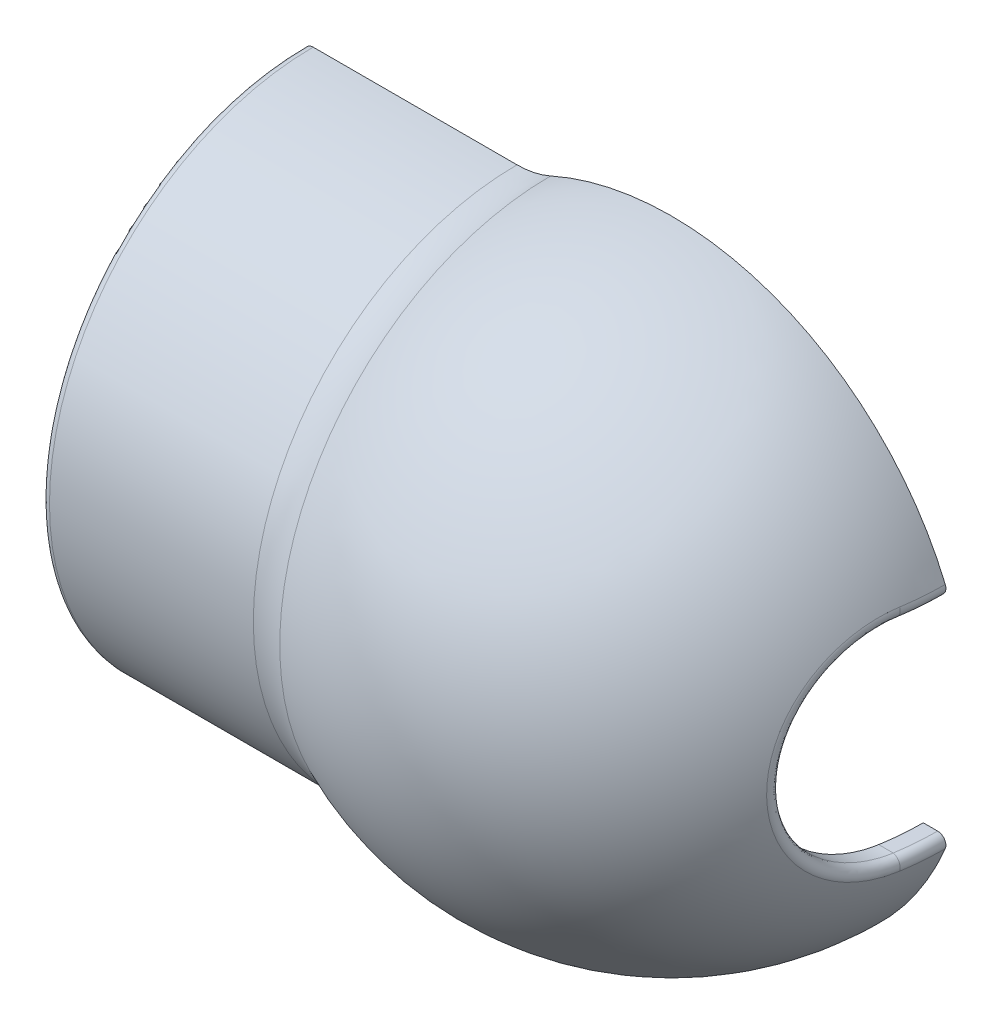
ISO-10303-21;
HEADER;
FILE_DESCRIPTION(('STEP AP214'),'2;1');
FILE_NAME('part.step','',(''),(''),'','','');
FILE_SCHEMA(('AUTOMOTIVE_DESIGN { 1 0 10303 214 1 1 1 1 }'));
ENDSEC;
DATA;
#1=APPLICATION_CONTEXT('core data for automotive mechanical design processes');
#2=APPLICATION_PROTOCOL_DEFINITION('international standard','automotive_design',2000,#1);
#3=PRODUCT_CONTEXT('',#1,'mechanical');
#4=PRODUCT('Part','Part','',(#3));
#5=PRODUCT_RELATED_PRODUCT_CATEGORY('part','',(#4));
#6=PRODUCT_DEFINITION_FORMATION('','',#4);
#7=PRODUCT_DEFINITION_CONTEXT('part definition',#1,'design');
#8=PRODUCT_DEFINITION('design','',#6,#7);
#9=PRODUCT_DEFINITION_SHAPE('','',#8);
#10=(LENGTH_UNIT() NAMED_UNIT(*) SI_UNIT(.MILLI.,.METRE.));
#11=(NAMED_UNIT(*) PLANE_ANGLE_UNIT() SI_UNIT($,.RADIAN.));
#12=(NAMED_UNIT(*) SI_UNIT($,.STERADIAN.) SOLID_ANGLE_UNIT());
#13=UNCERTAINTY_MEASURE_WITH_UNIT(LENGTH_MEASURE(1.E-05),#10,'distance_accuracy_value','');
#14=(GEOMETRIC_REPRESENTATION_CONTEXT(3) GLOBAL_UNCERTAINTY_ASSIGNED_CONTEXT((#13)) GLOBAL_UNIT_ASSIGNED_CONTEXT((#10,
#11,#12)) REPRESENTATION_CONTEXT('',''));
#15=CARTESIAN_POINT('',(0.,0.,0.));
#16=DIRECTION('',(0.,0.,1.));
#17=DIRECTION('',(1.,0.,0.));
#18=AXIS2_PLACEMENT_3D('',#15,#16,#17);
#19=CARTESIAN_POINT('',(0.,0.,0.));
#20=DIRECTION('',(-1.,0.,0.));
#21=DIRECTION('',(0.,-1.,0.));
#22=AXIS2_PLACEMENT_3D('',#19,#20,#21);
#23=SPHERICAL_SURFACE('',#22,36.);
#24=CARTESIAN_POINT('',(32.6008631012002,-11.7829416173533,0.827196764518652));
#25=CARTESIAN_POINT('',(33.1147385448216,-11.8077421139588,0.89722709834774));
#26=CARTESIAN_POINT('',(33.410378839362,-12.2223332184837,0.795746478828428));
#27=CARTESIAN_POINT('',(33.7060191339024,-12.6369243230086,0.694265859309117));
#28=CARTESIAN_POINT('',(33.5323163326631,-13.0891648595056,0.507468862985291));
#29=CARTESIAN_POINT('',(32.5454260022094,-11.9015078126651,1.1618895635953));
#30=CARTESIAN_POINT('',(33.0604249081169,-11.92473238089,1.23378883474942));
#31=CARTESIAN_POINT('',(33.3559038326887,-12.3438678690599,1.14379459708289));
#32=CARTESIAN_POINT('',(33.651323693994,-12.7631377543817,1.05417823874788));
#33=CARTESIAN_POINT('',(33.4752953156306,-13.2208749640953,0.879264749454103));
#34=CARTESIAN_POINT('',(32.48902616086,-12.005699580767,1.5015251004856));
#35=CARTESIAN_POINT('',(33.0052092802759,-12.0271277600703,1.57499175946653));
#36=CARTESIAN_POINT('',(33.3004954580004,-12.4504058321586,1.49686845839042));
#37=CARTESIAN_POINT('',(33.5957197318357,-12.8737854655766,1.41913868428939));
#38=CARTESIAN_POINT('',(33.4172840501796,-13.3366171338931,1.25655131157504));
#39=CARTESIAN_POINT('',(32.3746937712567,-12.1848006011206,2.18818956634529));
#40=CARTESIAN_POINT('',(32.8933088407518,-12.2024351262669,2.26447947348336));
#41=CARTESIAN_POINT('',(33.1882009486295,-12.6329724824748,2.21045343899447));
#42=CARTESIAN_POINT('',(33.4830319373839,-13.0636082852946,2.1568156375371));
#43=CARTESIAN_POINT('',(33.2996850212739,-13.5355727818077,2.01933743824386));
#44=CARTESIAN_POINT('',(32.3167613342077,-12.2597119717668,2.53521795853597));
#45=CARTESIAN_POINT('',(32.8366205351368,-12.275320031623,2.61278377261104));
#46=CARTESIAN_POINT('',(33.1313149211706,-12.7090033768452,2.57096401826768));
#47=CARTESIAN_POINT('',(33.4259445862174,-13.1427545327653,2.52955320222));
#48=CARTESIAN_POINT('',(33.2400973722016,-13.6187886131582,2.40483640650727));
#49=CARTESIAN_POINT('',(32.1997882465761,-12.3796949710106,3.23398714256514));
#50=CARTESIAN_POINT('',(32.7221936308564,-12.3910989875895,3.31374998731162));
#51=CARTESIAN_POINT('',(33.0164852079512,-12.8300164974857,3.29661210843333));
#52=CARTESIAN_POINT('',(33.3107118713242,-13.2690028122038,3.27988449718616));
#53=CARTESIAN_POINT('',(33.1197821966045,-13.7520725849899,3.18106914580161));
#54=CARTESIAN_POINT('',(32.1407483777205,-12.4247868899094,3.58572456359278));
#55=CARTESIAN_POINT('',(32.6644528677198,-12.4339813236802,3.66642423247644));
#56=CARTESIAN_POINT('',(32.958542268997,-12.8750198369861,3.66174630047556));
#57=CARTESIAN_POINT('',(33.2525643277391,-13.3160923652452,3.6574915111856));
#58=CARTESIAN_POINT('',(33.0590554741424,-13.8021632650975,3.57179917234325));
#59=CARTESIAN_POINT('',(32.0219255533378,-12.4849392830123,4.29164923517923));
#60=CARTESIAN_POINT('',(32.5482797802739,-12.4896228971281,4.37384453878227));
#61=CARTESIAN_POINT('',(32.8419598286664,-12.9338220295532,4.394273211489));
#62=CARTESIAN_POINT('',(33.1355725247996,-13.3780550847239,4.41512507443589));
#63=CARTESIAN_POINT('',(32.9368377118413,-13.8689839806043,4.35598063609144));
#64=CARTESIAN_POINT('',(31.9621425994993,-12.4999998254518,4.64583648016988));
#65=CARTESIAN_POINT('',(32.489845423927,-12.5023479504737,4.72860050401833));
#66=CARTESIAN_POINT('',(32.7833203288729,-12.9476209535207,4.76166592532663));
#67=CARTESIAN_POINT('',(33.0767262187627,-13.3928917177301,4.7951624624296));
#68=CARTESIAN_POINT('',(32.8753466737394,-13.8857140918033,4.74943206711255));
#69=CARTESIAN_POINT('',(31.8421097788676,-12.5000001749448,5.35496807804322));
#70=CARTESIAN_POINT('',(32.3725565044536,-12.4976439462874,5.4384754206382));
#71=CARTESIAN_POINT('',(32.6656180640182,-12.9439654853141,5.49693792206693));
#72=CARTESIAN_POINT('',(32.9586102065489,-13.3902849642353,5.55583407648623));
#73=CARTESIAN_POINT('',(32.7518843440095,-13.8857144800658,5.53717596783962));
#74=CARTESIAN_POINT('',(31.7818591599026,-12.4848714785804,5.70991232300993));
#75=CARTESIAN_POINT('',(32.3137003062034,-12.4801106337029,5.79359673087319));
#76=CARTESIAN_POINT('',(32.6065546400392,-12.9264400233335,5.86481641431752));
#77=CARTESIAN_POINT('',(32.8993388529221,-13.3727299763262,5.93647154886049));
#78=CARTESIAN_POINT('',(32.6899122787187,-13.8689086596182,5.93146831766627));
#79=CARTESIAN_POINT('',(31.6614279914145,-12.4244574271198,6.41737079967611));
#80=CARTESIAN_POINT('',(32.1960933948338,-12.4149262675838,6.50100477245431));
#81=CARTESIAN_POINT('',(32.4885329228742,-12.860153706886,6.59774463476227));
#82=CARTESIAN_POINT('',(32.7809022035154,-13.3053417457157,6.69492074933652));
#83=CARTESIAN_POINT('',(32.5660402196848,-13.8017972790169,6.71735361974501));
#84=CARTESIAN_POINT('',(31.6012474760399,-12.3791609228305,6.76988408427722));
#85=CARTESIAN_POINT('',(32.1373425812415,-12.3672280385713,6.85328867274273));
#86=CARTESIAN_POINT('',(32.4295746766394,-12.8113813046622,6.96279326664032));
#87=CARTESIAN_POINT('',(32.721736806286,-13.2554579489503,7.07272977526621));
#88=CARTESIAN_POINT('',(32.504140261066,-13.7514793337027,7.10894551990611));
#89=CARTESIAN_POINT('',(31.4814419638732,-12.258740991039,7.46966651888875));
#90=CARTESIAN_POINT('',(32.020420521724,-12.2421153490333,7.55221135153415));
#91=CARTESIAN_POINT('',(32.3122400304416,-12.6829986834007,7.68714324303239));
#92=CARTESIAN_POINT('',(32.6039895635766,-13.1238055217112,7.82250712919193));
#93=CARTESIAN_POINT('',(32.3809117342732,-13.6177099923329,7.88630383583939));
#94=CARTESIAN_POINT('',(31.4218166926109,-12.1836331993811,7.81693831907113));
#95=CARTESIAN_POINT('',(31.9622497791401,-12.1646811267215,7.89884566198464));
#96=CARTESIAN_POINT('',(32.2538633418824,-12.6034046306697,8.04644749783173));
#97=CARTESIAN_POINT('',(32.5454082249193,-13.0420156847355,8.19447080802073));
#98=CARTESIAN_POINT('',(32.3195828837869,-13.5342759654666,8.27207319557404));
#99=CARTESIAN_POINT('',(31.3035037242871,-12.0040624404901,8.50408846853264));
#100=CARTESIAN_POINT('',(31.8468597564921,-11.9806353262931,8.58433586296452));
#101=CARTESIAN_POINT('',(32.1380661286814,-12.4139210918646,8.75708801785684));
#102=CARTESIAN_POINT('',(32.4292036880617,-12.8470943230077,8.93026248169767));
#103=CARTESIAN_POINT('',(32.1978895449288,-13.3347985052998,9.03539884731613));
#104=CARTESIAN_POINT('',(31.2448163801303,-11.8995886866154,8.84396405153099));
#105=CARTESIAN_POINT('',(31.7896426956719,-11.8739794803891,8.92317525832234));
#106=CARTESIAN_POINT('',(32.0806459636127,-12.3040204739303,9.10842130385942));
#107=CARTESIAN_POINT('',(32.371582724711,-12.7339152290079,9.29407310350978));
#108=CARTESIAN_POINT('',(32.1375254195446,-13.2187430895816,9.41295206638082));
#109=CARTESIAN_POINT('',(31.1288482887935,-11.6620142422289,9.51371908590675));
#110=CARTESIAN_POINT('',(31.6766157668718,-11.6322873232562,9.59050074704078));
#111=CARTESIAN_POINT('',(31.967220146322,-12.054734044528,9.80043924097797));
#112=CARTESIAN_POINT('',(32.2577579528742,-12.4770345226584,10.0107839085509));
#113=CARTESIAN_POINT('',(32.0182439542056,-12.9548318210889,10.1569542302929));
#114=CARTESIAN_POINT('',(31.0715673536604,-11.5289174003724,9.84359987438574));
#115=CARTESIAN_POINT('',(31.6208085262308,-11.4972239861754,9.91896920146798));
#116=CARTESIAN_POINT('',(31.9112143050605,-11.9153521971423,10.1411253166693));
#117=CARTESIAN_POINT('',(32.2015567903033,-12.3333038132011,10.363665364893));
#118=CARTESIAN_POINT('',(31.9593264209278,-12.8069802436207,10.5234046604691));
#119=CARTESIAN_POINT('',(30.9588212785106,-11.2349282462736,10.4911633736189));
#120=CARTESIAN_POINT('',(31.5109973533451,-11.199610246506,10.5633902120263));
#121=CARTESIAN_POINT('',(31.8010156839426,-11.6080165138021,10.8095924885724));
#122=CARTESIAN_POINT('',(32.0909705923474,-12.0162459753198,11.0561794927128));
#123=CARTESIAN_POINT('',(31.8433590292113,-12.4804002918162,11.2427551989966));
#124=CARTESIAN_POINT('',(30.903356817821,-11.0740256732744,10.8088415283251));
#125=CARTESIAN_POINT('',(31.4569978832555,-11.0370226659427,10.8793136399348));
#126=CARTESIAN_POINT('',(31.7468235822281,-11.4400521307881,11.1373687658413));
#127=CARTESIAN_POINT('',(32.0365900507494,-11.8428787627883,11.3957811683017));
#128=CARTESIAN_POINT('',(31.7863098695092,-12.3016605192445,11.5956502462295));
#129=CARTESIAN_POINT('',(30.7947145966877,-10.7255893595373,11.429491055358));
#130=CARTESIAN_POINT('',(31.3512573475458,-10.6855826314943,11.4961879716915));
#131=CARTESIAN_POINT('',(31.640710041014,-11.0768070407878,11.7774530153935));
#132=CARTESIAN_POINT('',(31.9301034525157,-11.4678285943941,12.0590756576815));
#133=CARTESIAN_POINT('',(31.6745635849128,-11.9145975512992,12.2851032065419));
#134=CARTESIAN_POINT('',(30.741536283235,-10.5380621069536,11.7324659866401));
#135=CARTESIAN_POINT('',(31.2995203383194,-10.4967141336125,11.7971136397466));
#136=CARTESIAN_POINT('',(31.5887880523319,-10.8815329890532,12.0897647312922));
#137=CARTESIAN_POINT('',(31.8780014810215,-11.2661282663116,12.3827415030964));
#138=CARTESIAN_POINT('',(31.6198658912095,-11.7062815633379,12.6216650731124));
#139=CARTESIAN_POINT('',(30.6378611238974,-10.1375504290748,12.3216809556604));
#140=CARTESIAN_POINT('',(31.1986844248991,-10.0939327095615,12.3820255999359));
#141=CARTESIAN_POINT('',(31.4875966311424,-10.4649264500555,12.696862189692));
#142=CARTESIAN_POINT('',(31.7764544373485,-10.8356963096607,13.0120251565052));
#143=CARTESIAN_POINT('',(31.5132285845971,-11.2613703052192,13.2761987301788));
#144=CARTESIAN_POINT('',(30.5873652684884,-9.92455669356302,12.6079148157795));
#145=CARTESIAN_POINT('',(31.1495918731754,-9.8799938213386,12.665972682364));
#146=CARTESIAN_POINT('',(31.43832817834,-10.2435844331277,12.9916414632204));
#147=CARTESIAN_POINT('',(31.727015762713,-10.6069365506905,13.3176010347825));
#148=CARTESIAN_POINT('',(31.4612899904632,-11.0247646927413,13.5941636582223));
#149=CARTESIAN_POINT('',(30.48975401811,-9.47582984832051,13.1599323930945));
#150=CARTESIAN_POINT('',(31.0547195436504,-9.42983157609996,13.2132954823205));
#151=CARTESIAN_POINT('',(31.3431212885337,-9.77769509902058,13.5598879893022));
#152=CARTESIAN_POINT('',(31.6314747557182,-10.1253224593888,13.9067686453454));
#153=CARTESIAN_POINT('',(31.3608898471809,-10.5262932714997,14.2073763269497));
#154=CARTESIAN_POINT('',(30.4426221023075,-9.24022344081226,13.4258165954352));
#155=CARTESIAN_POINT('',(31.0089291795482,-9.19372082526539,13.4767385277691));
#156=CARTESIAN_POINT('',(31.2971665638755,-9.53327719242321,13.8334600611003));
#157=CARTESIAN_POINT('',(31.5853617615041,-9.87258968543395,14.1904321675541));
#158=CARTESIAN_POINT('',(31.3124113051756,-10.2645682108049,14.5027356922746));
#159=CARTESIAN_POINT('',(30.3518250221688,-8.74686181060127,13.9369240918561));
#160=CARTESIAN_POINT('',(30.9207387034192,-8.69981800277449,13.9829097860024));
#161=CARTESIAN_POINT('',(31.2086655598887,-9.02186533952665,14.3591237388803));
#162=CARTESIAN_POINT('',(31.4965501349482,-9.34366844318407,14.7355888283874));
#163=CARTESIAN_POINT('',(31.219020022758,-9.71651391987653,15.0705031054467));
#164=CARTESIAN_POINT('',(30.3081611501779,-8.4890984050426,14.1821396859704));
#165=CARTESIAN_POINT('',(30.8783461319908,-8.44201419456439,14.2255930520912));
#166=CARTESIAN_POINT('',(31.1661205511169,-8.75486305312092,14.6112073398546));
#167=CARTESIAN_POINT('',(31.4538590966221,-9.06746709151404,14.9970337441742));
#168=CARTESIAN_POINT('',(31.1741086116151,-9.43017559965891,15.3429025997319));
#169=CARTESIAN_POINT('',(30.2247166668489,-7.95342701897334,14.6498373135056));
#170=CARTESIAN_POINT('',(30.7973494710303,-7.90673785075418,14.6882570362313));
#171=CARTESIAN_POINT('',(31.0848388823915,-8.20037147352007,15.0918125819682));
#172=CARTESIAN_POINT('',(31.3722923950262,-8.4937602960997,15.4955803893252));
#173=CARTESIAN_POINT('',(31.0882800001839,-8.83512121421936,15.8624478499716));
#174=CARTESIAN_POINT('',(30.1849342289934,-7.67552862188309,14.8723300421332));
#175=CARTESIAN_POINT('',(30.758750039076,-7.62927775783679,14.9082107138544));
#176=CARTESIAN_POINT('',(31.0461004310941,-7.9128919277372,15.3203453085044));
#177=CARTESIAN_POINT('',(31.3334214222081,-8.19626809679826,15.7326530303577));
#178=CARTESIAN_POINT('',(31.0473609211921,-8.52641579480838,16.1096054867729));
#179=CARTESIAN_POINT('',(30.1095673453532,-7.10133916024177,15.2930903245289));
#180=CARTESIAN_POINT('',(30.6856385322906,-7.05643206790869,15.3240070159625));
#181=CARTESIAN_POINT('',(30.9727318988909,-7.31926037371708,15.7523689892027));
#182=CARTESIAN_POINT('',(31.2597957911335,-7.58185031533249,16.1809045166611));
#183=CARTESIAN_POINT('',(30.9698406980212,-7.8885733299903,16.5770100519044));
#184=CARTESIAN_POINT('',(30.0739844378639,-6.8050414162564,15.491349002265));
#185=CARTESIAN_POINT('',(30.6511344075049,-6.7610503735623,15.5198034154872));
#186=CARTESIAN_POINT('',(30.9381033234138,-7.01310158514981,15.9558507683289));
#187=CARTESIAN_POINT('',(31.2250491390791,-7.26492867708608,16.3920336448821));
#188=CARTESIAN_POINT('',(30.9332411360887,-7.55942886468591,16.7972471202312));
#189=CARTESIAN_POINT('',(30.0077730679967,-6.20008092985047,15.8596887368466));
#190=CARTESIAN_POINT('',(30.5869408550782,-6.15835234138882,15.8834457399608));
#191=CARTESIAN_POINT('',(30.8736839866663,-6.38832973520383,16.3337694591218));
#192=CARTESIAN_POINT('',(31.1604045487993,-6.61808831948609,16.7842255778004));
#193=CARTESIAN_POINT('',(30.8651380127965,-6.88740418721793,17.2064199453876));
#194=CARTESIAN_POINT('',(29.977088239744,-5.89161902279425,16.0300910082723));
#195=CARTESIAN_POINT('',(30.5572023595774,-5.8512454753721,16.0515775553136));
#196=CARTESIAN_POINT('',(30.8438381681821,-6.0699201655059,16.5085376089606));
#197=CARTESIAN_POINT('',(31.1304571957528,-6.28839662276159,16.9655957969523));
#198=CARTESIAN_POINT('',(30.83357647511,-6.54474707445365,17.3957125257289));
#199=CARTESIAN_POINT('',(29.920410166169,-5.26099257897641,16.3444314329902));
#200=CARTESIAN_POINT('',(30.5022787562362,-5.22372012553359,16.3616468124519));
#201=CARTESIAN_POINT('',(30.7887217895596,-5.41923768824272,16.8308403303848));
#202=CARTESIAN_POINT('',(31.0751479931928,-5.61455668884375,17.3001322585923));
#203=CARTESIAN_POINT('',(30.7752790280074,-5.84421118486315,17.7448998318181));
#204=CARTESIAN_POINT('',(29.8944186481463,-4.93882305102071,16.4883598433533));
#205=CARTESIAN_POINT('',(30.4771008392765,-4.90331990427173,16.5035431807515));
#206=CARTESIAN_POINT('',(30.763452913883,-5.08695973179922,16.978364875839));
#207=CARTESIAN_POINT('',(31.0497933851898,-5.27042790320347,17.4532542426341));
#208=CARTESIAN_POINT('',(30.7485448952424,-5.48632686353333,17.9047837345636));
#209=CARTESIAN_POINT('',(29.8473904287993,-4.28333407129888,16.7485034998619));
#210=CARTESIAN_POINT('',(30.4315481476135,-4.25170369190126,16.7599633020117));
#211=CARTESIAN_POINT('',(30.7177404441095,-4.41114421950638,17.2449457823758));
#212=CARTESIAN_POINT('',(31.0039211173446,-4.57041302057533,17.7299960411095));
#213=CARTESIAN_POINT('',(30.7001730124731,-4.75817224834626,18.1937661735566));
#214=CARTESIAN_POINT('',(29.8263517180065,-3.95001920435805,16.8647299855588));
#215=CARTESIAN_POINT('',(30.4111762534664,-3.92052082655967,16.8744708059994));
#216=CARTESIAN_POINT('',(30.6972948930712,-4.06761129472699,17.3640136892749));
#217=CARTESIAN_POINT('',(30.9834063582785,-4.21456249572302,17.8535983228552));
#218=CARTESIAN_POINT('',(30.6785331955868,-4.38790704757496,18.3228771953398));
#219=CARTESIAN_POINT('',(29.7894060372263,-3.27441105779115,17.0686694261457));
#220=CARTESIAN_POINT('',(30.3754025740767,-3.2494424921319,17.0753694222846));
#221=CARTESIAN_POINT('',(30.6613958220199,-3.3714848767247,17.5729011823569));
#222=CARTESIAN_POINT('',(30.9473818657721,-3.49338771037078,18.0704748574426));
#223=CARTESIAN_POINT('',(30.640531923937,-3.63740291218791,18.5494247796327));
#224=CARTESIAN_POINT('',(29.7735008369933,-2.93211472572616,17.1563725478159));
#225=CARTESIAN_POINT('',(30.3600064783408,-2.90957776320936,17.1617284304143));
#226=CARTESIAN_POINT('',(30.6459440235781,-3.01888830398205,17.6627106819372));
#227=CARTESIAN_POINT('',(30.931877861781,-3.12809640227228,18.1637144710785));
#228=CARTESIAN_POINT('',(30.6241722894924,-3.25716058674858,18.6468504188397));
#229=CARTESIAN_POINT('',(29.7471501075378,-2.24551172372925,17.3015955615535));
#230=CARTESIAN_POINT('',(30.3344987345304,-2.22799167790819,17.304719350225));
#231=CARTESIAN_POINT('',(30.6203468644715,-2.31176450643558,17.8114033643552));
#232=CARTESIAN_POINT('',(30.906191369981,-2.39543724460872,18.3181084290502));
#233=CARTESIAN_POINT('',(30.5970686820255,-2.49444273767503,18.80817244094));
#234=CARTESIAN_POINT('',(29.7366383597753,-1.90128462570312,17.359481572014));
#235=CARTESIAN_POINT('',(30.3243258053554,-1.8863827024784,17.3616960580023));
#236=CARTESIAN_POINT('',(30.6101371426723,-1.95731748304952,17.8706616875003));
#237=CARTESIAN_POINT('',(30.8959471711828,-2.02819118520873,18.3796349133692));
#238=CARTESIAN_POINT('',(30.5862565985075,-2.11205560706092,18.8724755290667));
#239=CARTESIAN_POINT('',(29.7208730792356,-1.20909481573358,17.4462746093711));
#240=CARTESIAN_POINT('',(30.3090676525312,-1.19952354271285,17.4471287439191));
#241=CARTESIAN_POINT('',(30.5948255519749,-1.24466059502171,17.9595069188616));
#242=CARTESIAN_POINT('',(30.8805821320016,-1.28973639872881,18.4718927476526));
#243=CARTESIAN_POINT('',(30.5700408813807,-1.34313161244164,18.9688901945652));
#244=CARTESIAN_POINT('',(29.7156195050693,-0.861132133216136,17.4751818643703));
#245=CARTESIAN_POINT('',(30.3039841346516,-0.854312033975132,17.4755751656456));
#246=CARTESIAN_POINT('',(30.5897236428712,-0.886450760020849,17.9890940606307));
#247=CARTESIAN_POINT('',(30.8754630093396,-0.91856924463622,18.5026137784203));
#248=CARTESIAN_POINT('',(30.5646372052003,-0.956594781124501,19.0010020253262));
#249=CARTESIAN_POINT('',(29.7104195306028,-0.163929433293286,17.5037942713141));
#250=CARTESIAN_POINT('',(30.2989518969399,-0.162616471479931,17.5037347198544));
#251=CARTESIAN_POINT('',(30.5846737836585,-0.168743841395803,18.0183794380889));
#252=CARTESIAN_POINT('',(30.8703955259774,-0.174850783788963,18.5330249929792));
#253=CARTESIAN_POINT('',(30.5592886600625,-0.182102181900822,19.0327863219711));
#254=CARTESIAN_POINT('',(29.710473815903,0.185310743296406,17.5034956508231));
#255=CARTESIAN_POINT('',(30.2990044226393,0.183827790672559,17.5034408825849));
#256=CARTESIAN_POINT('',(30.5847264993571,0.190753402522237,18.0180738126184));
#257=CARTESIAN_POINT('',(30.8704484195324,0.197657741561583,18.5327076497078));
#258=CARTESIAN_POINT('',(30.5593444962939,0.205853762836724,19.0324545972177));
#259=CARTESIAN_POINT('',(29.7158898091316,0.882385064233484,17.473694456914));
#260=CARTESIAN_POINT('',(30.304245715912,0.875397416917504,17.4741113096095));
#261=CARTESIAN_POINT('',(30.5899861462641,0.908329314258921,17.9875716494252));
#262=CARTESIAN_POINT('',(30.8757264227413,0.941240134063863,18.501032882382));
#263=CARTESIAN_POINT('',(30.5649152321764,0.980203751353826,18.999349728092));
#264=CARTESIAN_POINT('',(29.7212496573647,1.23021965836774,17.4442021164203));
#265=CARTESIAN_POINT('',(30.3094320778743,1.22048329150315,17.4450890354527));
#266=CARTESIAN_POINT('',(30.5951912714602,1.26640843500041,17.9573855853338));
#267=CARTESIAN_POINT('',(30.8809491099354,1.31227154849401,18.4696899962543));
#268=CARTESIAN_POINT('',(30.5704282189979,1.36659829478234,18.9665879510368));
#269=CARTESIAN_POINT('',(29.737176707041,1.92007117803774,17.3565170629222));
#270=CARTESIAN_POINT('',(30.3248468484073,1.90502668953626,17.3587778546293));
#271=CARTESIAN_POINT('',(30.6106600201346,1.97666125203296,17.8676269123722));
#272=CARTESIAN_POINT('',(30.8964718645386,2.04823468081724,18.3764836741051));
#273=CARTESIAN_POINT('',(30.586810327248,2.1329247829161,18.8691823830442));
#274=CARTESIAN_POINT('',(29.7477131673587,2.26211026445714,17.2984937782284));
#275=CARTESIAN_POINT('',(30.3350437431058,2.2444669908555,17.3016656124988));
#276=CARTESIAN_POINT('',(30.6208937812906,2.32885727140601,17.8082277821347));
#277=CARTESIAN_POINT('',(30.9067401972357,2.41314817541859,18.3148109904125));
#278=CARTESIAN_POINT('',(30.597647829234,2.51288134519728,18.8047268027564));
#279=CARTESIAN_POINT('',(29.7738767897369,2.93990031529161,17.1542992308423));
#280=CARTESIAN_POINT('',(30.3603704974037,2.91731048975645,17.159686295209));
#281=CARTESIAN_POINT('',(30.646309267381,3.02690852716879,17.6605875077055));
#282=CARTESIAN_POINT('',(30.9322444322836,3.13640743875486,18.1615096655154));
#283=CARTESIAN_POINT('',(30.6245589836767,3.26580926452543,18.644547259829));
#284=CARTESIAN_POINT('',(29.7895020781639,3.27565354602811,17.0681383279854));
#285=CARTESIAN_POINT('',(30.3754957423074,3.25068044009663,17.0748451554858));
#286=CARTESIAN_POINT('',(30.6614891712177,3.37276604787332,17.5723569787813));
#287=CARTESIAN_POINT('',(30.9474756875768,3.49471752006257,18.0699090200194));
#288=CARTESIAN_POINT('',(30.6406307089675,3.63878313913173,18.5488348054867));
#289=CARTESIAN_POINT('',(29.825708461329,3.93876236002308,16.86828168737));
#290=CARTESIAN_POINT('',(30.410553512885,3.90934081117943,16.877969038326));
#291=CARTESIAN_POINT('',(30.6966698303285,4.05601164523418,17.3676517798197));
#292=CARTESIAN_POINT('',(30.9827792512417,4.2025484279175,17.8573746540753));
#293=CARTESIAN_POINT('',(30.6778715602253,4.37540230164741,18.3268226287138));
#294=CARTESIAN_POINT('',(29.8462913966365,4.2661147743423,16.7545757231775));
#295=CARTESIAN_POINT('',(30.4304840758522,4.23459639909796,16.7659450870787));
#296=CARTESIAN_POINT('',(30.716672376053,4.39339652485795,17.2511666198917));
#297=CARTESIAN_POINT('',(31.0028495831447,4.55203182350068,17.7364528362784));
#298=CARTESIAN_POINT('',(30.6990425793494,4.73904406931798,18.200511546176));
#299=CARTESIAN_POINT('',(29.892215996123,4.90989127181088,16.5005508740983));
#300=CARTESIAN_POINT('',(30.4749673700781,4.87455603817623,16.5155600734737));
#301=CARTESIAN_POINT('',(30.7613116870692,5.05712560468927,16.9908591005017));
#302=CARTESIAN_POINT('',(31.0476449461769,5.23953064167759,17.4662226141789));
#303=CARTESIAN_POINT('',(30.7462793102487,5.45418778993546,17.918326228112));
#304=CARTESIAN_POINT('',(29.9175559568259,5.22631921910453,16.3602415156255));
#305=CARTESIAN_POINT('',(30.4995138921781,5.18923647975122,16.3772342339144));
#306=CARTESIAN_POINT('',(30.7859467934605,5.38347370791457,16.8470465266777));
#307=CARTESIAN_POINT('',(31.0723637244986,5.57752081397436,17.3169521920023));
#308=CARTESIAN_POINT('',(30.7723432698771,5.80569403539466,17.7624625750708));
#309=CARTESIAN_POINT('',(29.9728756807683,5.84731958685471,16.0534713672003));
#310=CARTESIAN_POINT('',(30.5531200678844,5.80715389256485,16.0746429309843));
#311=CARTESIAN_POINT('',(30.8397411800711,6.02420118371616,16.5325140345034));
#312=CARTESIAN_POINT('',(31.1263462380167,6.24105716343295,16.9904790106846));
#313=CARTESIAN_POINT('',(30.8292435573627,6.4955367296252,17.4216847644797));
#314=CARTESIAN_POINT('',(30.0028720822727,6.15184438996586,15.8869167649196));
#315=CARTESIAN_POINT('',(30.5821907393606,6.11032325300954,15.9103138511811));
#316=CARTESIAN_POINT('',(30.8689166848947,6.3385323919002,16.3616975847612));
#317=CARTESIAN_POINT('',(31.1556210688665,6.56653026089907,16.8132077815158));
#318=CARTESIAN_POINT('',(30.8600969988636,6.83382028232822,17.2366663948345));
#319=CARTESIAN_POINT('',(30.067162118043,6.74560704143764,15.5293328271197));
#320=CARTESIAN_POINT('',(30.6445199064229,6.70182457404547,15.5573067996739));
#321=CARTESIAN_POINT('',(30.931464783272,6.95170502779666,15.9948290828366));
#322=CARTESIAN_POINT('',(31.2183881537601,7.20137454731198,16.4324775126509));
#323=CARTESIAN_POINT('',(30.9262238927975,7.49340576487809,16.8394417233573));
#324=CARTESIAN_POINT('',(30.1014542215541,7.03485028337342,15.3383122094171));
#325=CARTESIAN_POINT('',(30.6777712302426,6.99014539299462,15.368670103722));
#326=CARTESIAN_POINT('',(30.9648358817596,7.25055191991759,15.7987860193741));
#327=CARTESIAN_POINT('',(31.2518731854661,7.51073396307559,16.2290629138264));
#328=CARTESIAN_POINT('',(30.9614957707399,7.81471368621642,16.6272451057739));
#329=CARTESIAN_POINT('',(30.1740611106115,7.59629186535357,14.9330883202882));
#330=CARTESIAN_POINT('',(30.7482018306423,7.55020232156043,14.9682609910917));
#331=CARTESIAN_POINT('',(31.0355140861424,7.83094777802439,15.3827418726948));
#332=CARTESIAN_POINT('',(31.3227990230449,8.11146880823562,15.7973835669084));
#333=CARTESIAN_POINT('',(31.0361771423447,8.43839507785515,16.1770992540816));
#334=CARTESIAN_POINT('',(30.2123771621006,7.86848479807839,14.7188777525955));
#335=CARTESIAN_POINT('',(30.7853764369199,7.82192318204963,14.756515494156));
#336=CARTESIAN_POINT('',(31.072822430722,8.11249125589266,15.1627332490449));
#337=CARTESIAN_POINT('',(31.3602351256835,8.40282797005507,15.5691477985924));
#338=CARTESIAN_POINT('',(31.0755879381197,8.74076254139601,15.9391419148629));
#339=CARTESIAN_POINT('',(30.2926869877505,8.3938079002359,14.2689561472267));
#340=CARTESIAN_POINT('',(30.8633249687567,8.34675936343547,14.3114897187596));
#341=CARTESIAN_POINT('',(31.1510451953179,8.65619188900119,14.7004375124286));
#342=CARTESIAN_POINT('',(31.4387321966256,8.96539338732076,15.0895816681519));
#343=CARTESIAN_POINT('',(31.1581923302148,9.32432146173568,15.4393432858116));
#344=CARTESIAN_POINT('',(30.3346794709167,8.64694470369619,14.0332526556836));
#345=CARTESIAN_POINT('',(30.9040916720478,8.59987741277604,14.0782518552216));
#346=CARTESIAN_POINT('',(31.1919583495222,8.91835579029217,14.4581582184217));
#347=CARTESIAN_POINT('',(31.479785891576,9.23660281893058,14.8382968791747));
#348=CARTESIAN_POINT('',(31.2013845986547,9.60552028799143,15.1775103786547));
#349=CARTESIAN_POINT('',(30.422494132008,9.1352793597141,13.5392406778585));
#350=CARTESIAN_POINT('',(30.9893770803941,9.08861299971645,13.5890913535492));
#351=CARTESIAN_POINT('',(31.2775444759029,9.42445221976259,13.9501389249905));
#352=CARTESIAN_POINT('',(31.5656719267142,9.76005516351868,14.3114236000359));
#353=CARTESIAN_POINT('',(31.2917082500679,10.1479903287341,14.6287336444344));
#354=CARTESIAN_POINT('',(30.4683535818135,9.37024741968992,13.2807106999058));
#355=CARTESIAN_POINT('',(31.0339268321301,9.32401081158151,13.3329787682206));
#356=CARTESIAN_POINT('',(31.3222540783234,9.66815060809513,13.6841687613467));
#357=CARTESIAN_POINT('',(31.6105355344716,10.0120604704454,14.0356318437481));
#358=CARTESIAN_POINT('',(31.3388779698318,10.4090062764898,14.3415437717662));
#359=CARTESIAN_POINT('',(30.563101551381,9.81744383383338,12.7452839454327));
#360=CARTESIAN_POINT('',(31.1260067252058,9.77248286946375,12.8022023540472));
#361=CARTESIAN_POINT('',(31.4146583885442,10.1323279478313,13.1330788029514));
#362=CARTESIAN_POINT('',(31.7032643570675,10.4919434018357,13.4642277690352));
#363=CARTESIAN_POINT('',(31.4363330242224,10.905777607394,13.7467611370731));
#364=CARTESIAN_POINT('',(30.6119890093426,10.0296800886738,12.4683936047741));
#365=CARTESIAN_POINT('',(31.1735301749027,9.98557377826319,12.5275789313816));
#366=CARTESIAN_POINT('',(31.4623520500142,10.3528149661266,12.847965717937));
#367=CARTESIAN_POINT('',(31.7511228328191,10.7198391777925,13.1686587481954));
#368=CARTESIAN_POINT('',(31.4866172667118,11.1415417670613,13.4391755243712));
#369=CARTESIAN_POINT('',(30.7124603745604,10.4302723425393,11.8978984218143));
#370=CARTESIAN_POINT('',(31.2712379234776,10.3882482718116,11.9613730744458));
#371=CARTESIAN_POINT('',(31.5604043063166,10.7693579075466,12.2602532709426));
#372=CARTESIAN_POINT('',(31.8495195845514,11.1502503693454,12.5594397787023));
#373=CARTESIAN_POINT('',(31.5899592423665,11.5865425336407,12.8054368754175));
#374=CARTESIAN_POINT('',(30.7640464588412,10.6186086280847,11.6042800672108));
#375=CARTESIAN_POINT('',(31.3214192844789,10.5778274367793,11.6698080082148));
#376=CARTESIAN_POINT('',(31.6107650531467,10.9653936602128,11.957639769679));
#377=CARTESIAN_POINT('',(31.9000549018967,11.3527611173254,12.2458084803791));
#378=CARTESIAN_POINT('',(31.6430192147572,11.7957572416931,12.479268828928));
#379=CARTESIAN_POINT('',(30.8694593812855,10.9699029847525,11.0027087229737));
#380=CARTESIAN_POINT('',(31.4240025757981,10.9319266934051,11.0720423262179));
#381=CARTESIAN_POINT('',(31.7137101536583,11.3314432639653,11.3373467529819));
#382=CARTESIAN_POINT('',(32.0033619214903,11.7307613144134,11.6029874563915));
#383=CARTESIAN_POINT('',(31.7514439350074,12.1859950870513,11.811009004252));
#384=CARTESIAN_POINT('',(30.9232854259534,11.1328699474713,10.6947608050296));
#385=CARTESIAN_POINT('',(31.4763992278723,11.0964755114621,10.7658749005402));
#386=CARTESIAN_POINT('',(31.7662937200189,11.5014662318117,11.0196725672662));
#387=CARTESIAN_POINT('',(32.0561283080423,11.9062818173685,11.2738331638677));
#388=CARTESIAN_POINT('',(31.8068078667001,12.3670281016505,11.4689228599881));
#389=CARTESIAN_POINT('',(31.033555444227,11.4345468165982,10.0621776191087));
#390=CARTESIAN_POINT('',(31.5837815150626,11.4015967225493,10.136538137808));
#391=CARTESIAN_POINT('',(31.874055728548,11.8166258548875,10.3668040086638));
#392=CARTESIAN_POINT('',(32.1642684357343,12.2314750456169,10.5974425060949));
#393=CARTESIAN_POINT('',(31.920228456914,12.7021480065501,10.7662133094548));
#394=CARTESIAN_POINT('',(31.0900255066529,11.572885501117,9.73736917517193));
#395=CARTESIAN_POINT('',(31.6387901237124,11.5418292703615,9.81321051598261));
#396=CARTESIAN_POINT('',(31.9292601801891,11.9613811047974,10.0314267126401));
#397=CARTESIAN_POINT('',(32.2196653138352,12.3807817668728,10.2500384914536));
#398=CARTESIAN_POINT('',(31.9783119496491,12.8558225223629,10.4053975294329));
#399=CARTESIAN_POINT('',(31.2044209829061,11.8215039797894,9.07753529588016));
#400=CARTESIAN_POINT('',(31.7502669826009,11.7944328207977,9.15595400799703));
#401=CARTESIAN_POINT('',(32.041130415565,12.2220035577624,9.34980359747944));
#402=CARTESIAN_POINT('',(32.3319290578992,12.6494232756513,9.54404794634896));
#403=CARTESIAN_POINT('',(32.0959758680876,13.1320021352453,9.67241635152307));
#404=CARTESIAN_POINT('',(31.2623458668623,11.9317938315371,8.74251357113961));
#405=CARTESIAN_POINT('',(31.8067317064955,11.9068430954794,8.82204893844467));
#406=CARTESIAN_POINT('',(32.0977956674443,12.3378811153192,9.00356172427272));
#407=CARTESIAN_POINT('',(32.3887923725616,12.768800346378,9.18548668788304));
#408=CARTESIAN_POINT('',(32.1555557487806,13.2545184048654,9.30025507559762));
#409=CARTESIAN_POINT('',(31.3791606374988,12.1235206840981,8.06497082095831));
#410=CARTESIAN_POINT('',(31.9206426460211,12.102934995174,8.14633545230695));
#411=CARTESIAN_POINT('',(32.212108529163,12.5398705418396,8.30300718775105));
#412=CARTESIAN_POINT('',(32.5035074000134,12.9766876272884,8.46008959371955));
#413=CARTESIAN_POINT('',(32.2757080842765,13.4674995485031,8.54760187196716));
#414=CARTESIAN_POINT('',(31.4380490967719,12.2049969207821,7.72246067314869));
#415=CARTESIAN_POINT('',(31.9780853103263,12.1866876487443,7.80455337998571));
#416=CARTESIAN_POINT('',(32.2697546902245,12.6260228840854,7.94870620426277));
#417=CARTESIAN_POINT('',(32.5613555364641,13.065274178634,8.09328150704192));
#418=CARTESIAN_POINT('',(32.3362790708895,13.5580080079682,8.16712202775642));
#419=CARTESIAN_POINT('',(31.5564216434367,12.3387389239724,7.03201414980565));
#420=CARTESIAN_POINT('',(32.0935906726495,12.3250374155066,7.11515410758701));
#421=CARTESIAN_POINT('',(32.3856675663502,12.7681388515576,7.23417459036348));
#422=CARTESIAN_POINT('',(32.677676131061,13.211156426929,7.35361626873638));
#423=CARTESIAN_POINT('',(32.4580336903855,13.7065762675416,7.40013457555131));
#424=CARTESIAN_POINT('',(31.6159054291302,12.3910187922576,6.68408047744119));
#425=CARTESIAN_POINT('',(32.1516519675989,12.3796825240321,6.76754882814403));
#426=CARTESIAN_POINT('',(32.4439339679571,12.8241170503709,6.8739469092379));
#427=CARTESIAN_POINT('',(32.7361471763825,13.2685036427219,6.98077155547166));
#428=CARTESIAN_POINT('',(32.5192170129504,13.7646517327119,7.01362997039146));
#429=CARTESIAN_POINT('',(31.7132740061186,12.4523542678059,6.11293357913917));
#430=CARTESIAN_POINT('',(32.2467424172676,12.4448859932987,6.19648719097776));
#431=CARTESIAN_POINT('',(32.5393393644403,12.8906457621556,6.28236667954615));
#432=CARTESIAN_POINT('',(32.8319085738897,13.3363861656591,6.36841815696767));
#433=CARTESIAN_POINT('',(32.6193675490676,13.8327866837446,6.37916735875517));
#434=CARTESIAN_POINT('',(31.7511057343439,12.4702245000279,5.89062174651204));
#435=CARTESIAN_POINT('',(32.2836883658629,12.4642607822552,5.97417624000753));
#436=CARTESIAN_POINT('',(32.5764155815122,12.9103221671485,6.05203957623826));
#437=CARTESIAN_POINT('',(32.8691151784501,13.3563734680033,6.13007480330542));
#438=CARTESIAN_POINT('',(32.6582801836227,13.8526379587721,6.13221067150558));
#439=CARTESIAN_POINT('',(31.8267101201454,12.494042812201,5.44555099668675));
#440=CARTESIAN_POINT('',(32.3575365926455,12.4910695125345,5.52894977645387));
#441=CARTESIAN_POINT('',(32.6505242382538,12.9373179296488,5.59080098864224));
#442=CARTESIAN_POINT('',(32.9434843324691,13.3835563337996,5.65282367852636));
#443=CARTESIAN_POINT('',(32.7360446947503,13.8790967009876,5.63780064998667));
#444=CARTESIAN_POINT('',(31.86448280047,12.5000012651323,5.2227926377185));
#445=CARTESIAN_POINT('',(32.3944389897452,12.4985227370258,5.30603494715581));
#446=CARTESIAN_POINT('',(32.6875566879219,12.9446480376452,5.35989018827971));
#447=CARTESIAN_POINT('',(32.9806470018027,13.3907725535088,5.41391650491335));
#448=CARTESIAN_POINT('',(32.7748965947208,13.8857156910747,5.390347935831));
#449=CARTESIAN_POINT('',(31.9619202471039,12.499997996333,4.64714975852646));
#450=CARTESIAN_POINT('',(32.4896284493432,12.5023373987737,4.72991334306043));
#451=CARTESIAN_POINT('',(32.7831022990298,12.9476122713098,4.76302756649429));
#452=CARTESIAN_POINT('',(33.0765077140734,13.3928849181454,4.79656927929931));
#453=CARTESIAN_POINT('',(32.8751179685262,13.8857120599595,4.75089093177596));
#454=CARTESIAN_POINT('',(32.0214927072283,12.4850472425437,4.2942135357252));
#455=CARTESIAN_POINT('',(32.5478569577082,12.4897138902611,4.37641137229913));
#456=CARTESIAN_POINT('',(32.8415352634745,12.9339208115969,4.3969331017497));
#457=CARTESIAN_POINT('',(33.1351467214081,13.3781612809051,4.41787484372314));
#458=CARTESIAN_POINT('',(32.9363924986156,13.8691039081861,4.35882920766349));
#459=CARTESIAN_POINT('',(32.1399308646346,12.4253108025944,3.59058856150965));
#460=CARTESIAN_POINT('',(32.6636536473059,12.4344743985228,3.67129878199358));
#461=CARTESIAN_POINT('',(32.9577400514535,12.8755386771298,3.66679462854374));
#462=CARTESIAN_POINT('',(33.2517594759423,13.3166366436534,3.66271132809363));
#463=CARTESIAN_POINT('',(33.0582146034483,13.8027452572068,3.57720237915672));
#464=CARTESIAN_POINT('',(32.1987961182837,12.3805072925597,3.23990127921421));
#465=CARTESIAN_POINT('',(32.7212234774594,12.3918744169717,3.31967930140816));
#466=CARTESIAN_POINT('',(33.0155114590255,12.8308294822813,3.302751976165));
#467=CARTESIAN_POINT('',(33.3097348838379,13.2698527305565,3.28623264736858));
#468=CARTESIAN_POINT('',(33.1187617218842,13.7529749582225,3.18763890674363));
#469=CARTESIAN_POINT('',(32.3158172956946,12.2608829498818,2.54086983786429));
#470=CARTESIAN_POINT('',(32.8356966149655,12.2764581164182,2.61845712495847));
#471=CARTESIAN_POINT('',(33.1303879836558,12.710190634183,2.57683504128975));
#472=CARTESIAN_POINT('',(33.4250141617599,13.1439912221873,2.53562484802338));
#473=CARTESIAN_POINT('',(33.2391263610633,13.6200894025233,2.4111148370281));
#474=CARTESIAN_POINT('',(32.3739648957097,12.1858452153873,2.19256151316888));
#475=CARTESIAN_POINT('',(32.8925953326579,12.2034553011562,2.26886975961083));
#476=CARTESIAN_POINT('',(33.1874851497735,12.6340352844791,2.21499602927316));
#477=CARTESIAN_POINT('',(33.4823134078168,13.0647143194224,2.1615133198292));
#478=CARTESIAN_POINT('',(33.2989353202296,13.5367331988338,2.02419404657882));
#479=CARTESIAN_POINT('',(32.4886853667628,12.0063298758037,1.50357743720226));
#480=CARTESIAN_POINT('',(33.00487545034,12.0277475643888,1.57705475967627));
#481=CARTESIAN_POINT('',(33.3001606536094,12.4510503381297,1.49900201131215));
#482=CARTESIAN_POINT('',(33.5953835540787,12.8744552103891,1.42134531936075));
#483=CARTESIAN_POINT('',(33.4169335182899,13.3373173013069,1.25883116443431));
#484=CARTESIAN_POINT('',(32.5452589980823,11.9018667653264,1.16289801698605));
#485=CARTESIAN_POINT('',(33.0602611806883,11.925086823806,1.23480360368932));
#486=CARTESIAN_POINT('',(33.3557397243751,12.3442358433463,1.14484331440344));
#487=CARTESIAN_POINT('',(33.6511588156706,12.7635201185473,1.05526339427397));
#488=CARTESIAN_POINT('',(33.4751235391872,13.2212737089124,0.880384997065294));
#489=CARTESIAN_POINT('',(32.6008631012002,11.7829416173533,0.82719676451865));
#490=CARTESIAN_POINT('',(33.1147385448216,11.8077421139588,0.897227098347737));
#491=CARTESIAN_POINT('',(33.410378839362,12.2223332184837,0.795746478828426));
#492=CARTESIAN_POINT('',(33.7060191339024,12.6369243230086,0.694265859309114));
#493=CARTESIAN_POINT('',(33.5323163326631,13.0891648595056,0.507468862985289));
#494=(BOUNDED_SURFACE() B_SPLINE_SURFACE(3,2,((#24,#25,#26,#27,#28),(#29,#30,#31,#32,#33),(#34,
#35,#36,#37,#38),(#39,#40,#41,#42,#43),(#44,#45,#46,#47,#48),(#49,#50,#51,#52,#53),(#54,#55,#56,
#57,#58),(#59,#60,#61,#62,#63),(#64,#65,#66,#67,#68),(#69,#70,#71,#72,#73),(#74,#75,#76,#77,
#78),(#79,#80,#81,#82,#83),(#84,#85,#86,#87,#88),(#89,#90,#91,#92,#93),(#94,#95,#96,#97,#98),
(#99,#100,#101,#102,#103),(#104,#105,#106,#107,#108),(#109,#110,#111,#112,#113),(#114,#115,#116,
#117,#118),(#119,#120,#121,#122,#123),(#124,#125,#126,#127,#128),(#129,#130,#131,#132,#133),
(#134,#135,#136,#137,#138),(#139,#140,#141,#142,#143),(#144,#145,#146,#147,#148),(#149,#150,
#151,#152,#153),(#154,#155,#156,#157,#158),(#159,#160,#161,#162,#163),(#164,#165,#166,#167,
#168),(#169,#170,#171,#172,#173),(#174,#175,#176,#177,#178),(#179,#180,#181,#182,#183),(#184,
#185,#186,#187,#188),(#189,#190,#191,#192,#193),(#194,#195,#196,#197,#198),(#199,#200,#201,#202,
#203),(#204,#205,#206,#207,#208),(#209,#210,#211,#212,#213),(#214,#215,#216,#217,#218),(#219,
#220,#221,#222,#223),(#224,#225,#226,#227,#228),(#229,#230,#231,#232,#233),(#234,#235,#236,#237,
#238),(#239,#240,#241,#242,#243),(#244,#245,#246,#247,#248),(#249,#250,#251,#252,#253),(#254,
#255,#256,#257,#258),(#259,#260,#261,#262,#263),(#264,#265,#266,#267,#268),(#269,#270,#271,#272,
#273),(#274,#275,#276,#277,#278),(#279,#280,#281,#282,#283),(#284,#285,#286,#287,#288),(#289,
#290,#291,#292,#293),(#294,#295,#296,#297,#298),(#299,#300,#301,#302,#303),(#304,#305,#306,#307,
#308),(#309,#310,#311,#312,#313),(#314,#315,#316,#317,#318),(#319,#320,#321,#322,#323),(#324,
#325,#326,#327,#328),(#329,#330,#331,#332,#333),(#334,#335,#336,#337,#338),(#339,#340,#341,#342,
#343),(#344,#345,#346,#347,#348),(#349,#350,#351,#352,#353),(#354,#355,#356,#357,#358),(#359,
#360,#361,#362,#363),(#364,#365,#366,#367,#368),(#369,#370,#371,#372,#373),(#374,#375,#376,#377,
#378),(#379,#380,#381,#382,#383),(#384,#385,#386,#387,#388),(#389,#390,#391,#392,#393),(#394,
#395,#396,#397,#398),(#399,#400,#401,#402,#403),(#404,#405,#406,#407,#408),(#409,#410,#411,#412,
#413),(#414,#415,#416,#417,#418),(#419,#420,#421,#422,#423),(#424,#425,#426,#427,#428),(#429,
#430,#431,#432,#433),(#434,#435,#436,#437,#438),(#439,#440,#441,#442,#443),(#444,#445,#446,#447,
#448),(#449,#450,#451,#452,#453),(#454,#455,#456,#457,#458),(#459,#460,#461,#462,#463),(#464,
#465,#466,#467,#468),(#469,#470,#471,#472,#473),(#474,#475,#476,#477,#478),(#479,#480,#481,#482,
#483),(#484,#485,#486,#487,#488),(#489,#490,#491,#492,#493)),.UNSPECIFIED.,.F.,.F.,
.F.) B_SPLINE_SURFACE_WITH_KNOTS((4,2,2,2,2,2,2,2,2,2,2,2,2,2,2,2,2,2,2,2,2,2,2,2,2,2,2,2,2,2,2,
2,2,2,2,2,2,2,2,2,2,2,2,2,2,2,4),(3,2,3),(0.,1.16203427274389,2.3239844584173,3.48514319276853,
4.64629928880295,5.81009319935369,6.97431745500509,8.13793188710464,9.30197429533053,
10.4658602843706,11.6301766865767,12.7942098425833,13.9586698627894,15.1169489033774,
16.2756575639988,17.4338183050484,18.5924019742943,19.7365047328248,20.8810277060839,
22.0250855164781,23.1695373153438,24.2995799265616,25.4296136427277,26.5597933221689,
27.6895769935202,28.8127311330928,29.9354722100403,31.058630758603,32.1813878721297,
33.3082532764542,34.4347182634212,35.5615387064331,36.6879650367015,37.8268698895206,
38.9653776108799,40.1048183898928,41.2438589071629,42.3988334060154,43.5533931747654,
44.7063746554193,45.8587987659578,46.5899570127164,47.320478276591,48.4774492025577,
49.6351115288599,50.8012312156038,51.9667774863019),(0.,0.5,1.),
.UNSPECIFIED.) GEOMETRIC_REPRESENTATION_ITEM() RATIONAL_B_SPLINE_SURFACE(((1.,0.887500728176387,
1.,0.887500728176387,1.),(1.,0.887032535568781,1.,0.887032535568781,1.),(1.,0.886554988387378,
1.,0.886554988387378,1.),(1.,0.885584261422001,1.,0.885584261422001,1.),(1.,0.885091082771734,
1.,0.885091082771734,1.),(1.,0.884092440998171,1.,0.884092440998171,1.),(1.,0.883586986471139,
1.,0.883586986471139,1.),(1.,0.882566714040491,1.,0.882566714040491,1.),(1.,0.882051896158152,
1.,0.882051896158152,1.),(1.,0.881015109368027,1.,0.881015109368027,1.),(1.,0.880493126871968,
1.,0.880493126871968,1.),(1.,0.879446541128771,1.,0.879446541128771,1.),(1.,0.87892193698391,1.,
0.87892193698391,1.),(1.,0.877874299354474,1.,0.877874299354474,1.),(1.,0.877351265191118,1.,
0.877351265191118,1.),(1.,0.876310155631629,1.,0.876310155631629,1.),(1.,0.875792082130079,1.,
0.875792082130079,1.),(1.,0.874765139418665,1.,0.874765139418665,1.),(1.,0.874256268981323,1.,
0.874256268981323,1.),(1.,0.873251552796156,1.,0.873251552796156,1.),(1.,0.872755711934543,1.,
0.872755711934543,1.),(1.,0.871781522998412,1.,0.871781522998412,1.),(1.,0.871303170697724,1.,
0.871303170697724,1.),(1.,0.870367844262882,1.,0.870367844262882,1.),(1.,0.869910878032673,1.,
0.869910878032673,1.),(1.,0.869025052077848,1.,0.869025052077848,1.),(1.,0.868596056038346,1.,
0.868596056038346,1.),(1.,0.867767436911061,1.,0.867767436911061,1.),(1.,0.86736782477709,1.,
0.86736782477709,1.),(1.,0.866602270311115,1.,0.866602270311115,1.),(1.,0.866236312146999,1.,
0.866236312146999,1.),(1.,0.865541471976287,1.,0.865541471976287,1.),(1.,0.865212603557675,1.,
0.865212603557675,1.),(1.,0.864599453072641,1.,0.864599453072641,1.),(1.,0.864314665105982,1.,
0.864314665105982,1.),(1.,0.863787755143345,1.,0.863787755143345,1.),(1.,0.863545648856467,1.,
0.863545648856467,1.),(1.,0.863106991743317,1.,0.863106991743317,1.),(1.,0.862910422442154,1.,
0.862910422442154,1.),(1.,0.862564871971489,1.,0.862564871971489,1.),(1.,0.86241590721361,1.,
0.86241590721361,1.),(1.,0.862168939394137,1.,0.862168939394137,1.),(1.,0.862070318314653,1.,
0.862070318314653,1.),(1.,0.861922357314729,1.,0.861922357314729,1.),(1.,0.861873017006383,1.,
0.861873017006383,1.),(1.,0.861824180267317,1.,0.861824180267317,1.),(1.,0.861824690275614,1.,
0.861824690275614,1.),(1.,0.861875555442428,1.,0.861875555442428,1.),(1.,0.861925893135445,1.,
0.861925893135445,1.),(1.,0.862075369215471,1.,0.862075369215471,1.),(1.,0.862174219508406,1.,
0.862174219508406,1.),(1.,0.862419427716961,1.,0.862419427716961,1.),(1.,0.862565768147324,1.,
0.862565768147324,1.),(1.,0.862904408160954,1.,0.862904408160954,1.),(1.,0.863096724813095,1.,
0.863096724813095,1.),(1.,0.863525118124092,1.,0.863525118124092,1.),(1.,0.863761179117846,1.,
0.863761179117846,1.),(1.,0.864275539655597,1.,0.864275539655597,1.),(1.,0.864553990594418,1.,
0.864553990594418,1.),(1.,0.865149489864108,1.,0.865149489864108,1.),(1.,0.865466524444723,1.,
0.865466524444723,1.),(1.,0.866136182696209,1.,0.866136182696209,1.),(1.,0.866488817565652,1.,
0.866488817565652,1.),(1.,0.867226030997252,1.,0.867226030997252,1.),(1.,0.867610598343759,1.,
0.867610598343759,1.),(1.,0.868412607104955,1.,0.868412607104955,1.),(1.,0.868830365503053,1.,
0.868830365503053,1.),(1.,0.869690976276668,1.,0.869690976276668,1.),(1.,0.870133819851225,1.,
0.870133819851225,1.),(1.,0.871041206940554,1.,0.871041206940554,1.),(1.,0.871505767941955,1.,
0.871505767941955,1.),(1.,0.872452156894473,1.,0.872452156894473,1.),(1.,0.872933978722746,1.,
0.872933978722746,1.),(1.,0.873917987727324,1.,0.873917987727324,1.),(1.,0.874420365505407,1.,
0.874420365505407,1.),(1.,0.875434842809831,1.,0.875434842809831,1.),(1.,0.875946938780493,1.,
0.875946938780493,1.),(1.,0.876976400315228,1.,0.876976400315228,1.),(1.,0.877493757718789,1.,
0.877493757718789,1.),(1.,0.878530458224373,1.,0.878530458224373,1.),(1.,0.879049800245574,1.,
0.879049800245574,1.),(1.,0.879897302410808,1.,0.879897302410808,1.),(1.,0.880225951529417,1.,
0.880225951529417,1.),(1.,0.880881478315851,1.,0.880881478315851,1.),(1.,0.881208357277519,1.,
0.881208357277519,1.),(1.,0.882049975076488,1.,0.882049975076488,1.),(1.,0.882562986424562,1.,
0.882562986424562,1.),(1.,0.883579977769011,1.,0.883579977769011,1.),(1.,0.884083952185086,1.,
0.884083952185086,1.),(1.,0.885083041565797,1.,0.885083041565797,1.),(1.,0.885578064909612,1.,
0.885578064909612,1.),(1.,0.886552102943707,1.,0.886552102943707,1.),(1.,0.887031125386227,1.,
0.887031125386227,1.),(1.,0.887500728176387,1.,0.887500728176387,1.))) REPRESENTATION_ITEM('') SURFACE());
#495=CARTESIAN_POINT('',(33.5323163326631,-13.0891648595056,0.507468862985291));
#496=CARTESIAN_POINT('',(33.4752953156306,-13.2208749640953,0.879264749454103));
#497=CARTESIAN_POINT('',(33.4172840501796,-13.3366171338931,1.25655131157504));
#498=CARTESIAN_POINT('',(33.2996850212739,-13.5355727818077,2.01933743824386));
#499=CARTESIAN_POINT('',(33.2400973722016,-13.6187886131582,2.40483640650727));
#500=CARTESIAN_POINT('',(33.1197821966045,-13.7520725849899,3.18106914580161));
#501=CARTESIAN_POINT('',(33.0590554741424,-13.8021632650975,3.57179917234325));
#502=CARTESIAN_POINT('',(32.9368377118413,-13.8689839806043,4.35598063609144));
#503=CARTESIAN_POINT('',(32.8753466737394,-13.8857140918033,4.74943206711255));
#504=CARTESIAN_POINT('',(32.7518843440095,-13.8857144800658,5.53717596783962));
#505=CARTESIAN_POINT('',(32.6899122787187,-13.8689086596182,5.93146831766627));
#506=CARTESIAN_POINT('',(32.5660402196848,-13.8017972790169,6.717353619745));
#507=CARTESIAN_POINT('',(32.504140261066,-13.7514793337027,7.10894551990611));
#508=CARTESIAN_POINT('',(32.3809117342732,-13.6177099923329,7.88630383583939));
#509=CARTESIAN_POINT('',(32.3195828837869,-13.5342759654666,8.27207319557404));
#510=CARTESIAN_POINT('',(32.1978895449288,-13.3347985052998,9.03539884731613));
#511=CARTESIAN_POINT('',(32.1375254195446,-13.2187430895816,9.41295206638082));
#512=CARTESIAN_POINT('',(32.0182439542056,-12.9548318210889,10.1569542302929));
#513=CARTESIAN_POINT('',(31.9593264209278,-12.8069802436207,10.5234046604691));
#514=CARTESIAN_POINT('',(31.8433590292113,-12.4804002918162,11.2427551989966));
#515=CARTESIAN_POINT('',(31.7863098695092,-12.3016605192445,11.5956502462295));
#516=CARTESIAN_POINT('',(31.6745635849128,-11.9145975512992,12.2851032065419));
#517=CARTESIAN_POINT('',(31.6198658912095,-11.7062815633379,12.6216650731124));
#518=CARTESIAN_POINT('',(31.5132285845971,-11.2613703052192,13.2761987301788));
#519=CARTESIAN_POINT('',(31.4612899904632,-11.0247646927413,13.5941636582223));
#520=CARTESIAN_POINT('',(31.3608898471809,-10.5262932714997,14.2073763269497));
#521=CARTESIAN_POINT('',(31.3124113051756,-10.2645682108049,14.5027356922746));
#522=CARTESIAN_POINT('',(31.219020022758,-9.71651391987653,15.0705031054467));
#523=CARTESIAN_POINT('',(31.1741086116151,-9.43017559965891,15.3429025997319));
#524=CARTESIAN_POINT('',(31.0882800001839,-8.83512121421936,15.8624478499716));
#525=CARTESIAN_POINT('',(31.0473609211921,-8.52641579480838,16.1096054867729));
#526=CARTESIAN_POINT('',(30.9698406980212,-7.8885733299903,16.5770100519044));
#527=CARTESIAN_POINT('',(30.9332411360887,-7.55942886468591,16.7972471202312));
#528=CARTESIAN_POINT('',(30.8651380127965,-6.88740418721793,17.2064199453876));
#529=CARTESIAN_POINT('',(30.83357647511,-6.54474707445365,17.3957125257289));
#530=CARTESIAN_POINT('',(30.7752790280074,-5.84421118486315,17.7448998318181));
#531=CARTESIAN_POINT('',(30.7485448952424,-5.48632686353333,17.9047837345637));
#532=CARTESIAN_POINT('',(30.7001730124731,-4.75817224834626,18.1937661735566));
#533=CARTESIAN_POINT('',(30.6785331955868,-4.38790704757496,18.3228771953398));
#534=CARTESIAN_POINT('',(30.640531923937,-3.63740291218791,18.5494247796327));
#535=CARTESIAN_POINT('',(30.6241722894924,-3.25716058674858,18.6468504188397));
#536=CARTESIAN_POINT('',(30.5970686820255,-2.49444273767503,18.80817244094));
#537=CARTESIAN_POINT('',(30.5862565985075,-2.11205560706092,18.8724755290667));
#538=CARTESIAN_POINT('',(30.5700408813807,-1.34313161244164,18.9688901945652));
#539=CARTESIAN_POINT('',(30.5646372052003,-0.956594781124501,19.0010020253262));
#540=CARTESIAN_POINT('',(30.5592886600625,-0.182102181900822,19.0327863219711));
#541=CARTESIAN_POINT('',(30.5593444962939,0.205853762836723,19.0324545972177));
#542=CARTESIAN_POINT('',(30.5649152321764,0.980203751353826,18.999349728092));
#543=CARTESIAN_POINT('',(30.5704282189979,1.36659829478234,18.9665879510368));
#544=CARTESIAN_POINT('',(30.586810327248,2.1329247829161,18.8691823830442));
#545=CARTESIAN_POINT('',(30.597647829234,2.51288134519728,18.8047268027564));
#546=CARTESIAN_POINT('',(30.6245589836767,3.26580926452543,18.644547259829));
#547=CARTESIAN_POINT('',(30.6406307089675,3.63878313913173,18.5488348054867));
#548=CARTESIAN_POINT('',(30.6778715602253,4.37540230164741,18.3268226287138));
#549=CARTESIAN_POINT('',(30.6990425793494,4.73904406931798,18.200511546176));
#550=CARTESIAN_POINT('',(30.7462793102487,5.45418778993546,17.918326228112));
#551=CARTESIAN_POINT('',(30.7723432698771,5.80569403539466,17.7624625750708));
#552=CARTESIAN_POINT('',(30.8292435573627,6.4955367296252,17.4216847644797));
#553=CARTESIAN_POINT('',(30.8600969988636,6.83382028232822,17.2366663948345));
#554=CARTESIAN_POINT('',(30.9262238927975,7.49340576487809,16.8394417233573));
#555=CARTESIAN_POINT('',(30.9614957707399,7.81471368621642,16.6272451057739));
#556=CARTESIAN_POINT('',(31.0361771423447,8.43839507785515,16.1770992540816));
#557=CARTESIAN_POINT('',(31.0755879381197,8.74076254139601,15.9391419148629));
#558=CARTESIAN_POINT('',(31.1581923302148,9.32432146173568,15.4393432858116));
#559=CARTESIAN_POINT('',(31.2013845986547,9.60552028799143,15.1775103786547));
#560=CARTESIAN_POINT('',(31.2917082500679,10.1479903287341,14.6287336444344));
#561=CARTESIAN_POINT('',(31.3388779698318,10.4090062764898,14.3415437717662));
#562=CARTESIAN_POINT('',(31.4363330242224,10.905777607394,13.7467611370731));
#563=CARTESIAN_POINT('',(31.4866172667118,11.1415417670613,13.4391755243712));
#564=CARTESIAN_POINT('',(31.5899592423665,11.5865425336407,12.8054368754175));
#565=CARTESIAN_POINT('',(31.6430192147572,11.7957572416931,12.479268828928));
#566=CARTESIAN_POINT('',(31.7514439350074,12.1859950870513,11.811009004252));
#567=CARTESIAN_POINT('',(31.8068078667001,12.3670281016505,11.4689228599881));
#568=CARTESIAN_POINT('',(31.920228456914,12.7021480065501,10.7662133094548));
#569=CARTESIAN_POINT('',(31.9783119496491,12.8558225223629,10.4053975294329));
#570=CARTESIAN_POINT('',(32.0959758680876,13.1320021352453,9.67241635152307));
#571=CARTESIAN_POINT('',(32.1555557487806,13.2545184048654,9.30025507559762));
#572=CARTESIAN_POINT('',(32.2757080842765,13.4674995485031,8.54760187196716));
#573=CARTESIAN_POINT('',(32.3362790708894,13.5580080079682,8.16712202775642));
#574=CARTESIAN_POINT('',(32.4580336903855,13.7065762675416,7.40013457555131));
#575=CARTESIAN_POINT('',(32.5192170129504,13.7646517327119,7.01362997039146));
#576=CARTESIAN_POINT('',(32.6193675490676,13.8327866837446,6.37916735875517));
#577=CARTESIAN_POINT('',(32.6582801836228,13.8526379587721,6.13221067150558));
#578=CARTESIAN_POINT('',(32.7360446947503,13.8790967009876,5.63780064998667));
#579=CARTESIAN_POINT('',(32.7748965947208,13.8857156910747,5.390347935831));
#580=CARTESIAN_POINT('',(32.8751179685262,13.8857120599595,4.75089093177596));
#581=CARTESIAN_POINT('',(32.9363924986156,13.8691039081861,4.35882920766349));
#582=CARTESIAN_POINT('',(33.0582146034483,13.8027452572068,3.57720237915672));
#583=CARTESIAN_POINT('',(33.1187617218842,13.7529749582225,3.18763890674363));
#584=CARTESIAN_POINT('',(33.2391263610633,13.6200894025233,2.4111148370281));
#585=CARTESIAN_POINT('',(33.2989353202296,13.5367331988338,2.02419404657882));
#586=CARTESIAN_POINT('',(33.4169335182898,13.3373173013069,1.25883116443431));
#587=CARTESIAN_POINT('',(33.4751235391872,13.2212737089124,0.880384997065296));
#588=CARTESIAN_POINT('',(33.5323163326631,13.0891648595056,0.507468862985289));
#589=B_SPLINE_CURVE_WITH_KNOTS('',3,(#495,#496,#497,#498,#499,#500,#501,#502,#503,#504,#505,
#506,#507,#508,#509,#510,#511,#512,#513,#514,#515,#516,#517,#518,#519,#520,#521,#522,#523,#524,
#525,#526,#527,#528,#529,#530,#531,#532,#533,#534,#535,#536,#537,#538,#539,#540,#541,#542,#543,
#544,#545,#546,#547,#548,#549,#550,#551,#552,#553,#554,#555,#556,#557,#558,#559,#560,#561,#562,
#563,#564,#565,#566,#567,#568,#569,#570,#571,#572,#573,#574,#575,#576,#577,#578,#579,#580,#581,
#582,#583,#584,#585,#586,#587,#588),.UNSPECIFIED.,.F.,.F.,(4,2,2,2,2,2,2,2,2,2,2,2,2,2,2,2,2,2,
2,2,2,2,2,2,2,2,2,2,2,2,2,2,2,2,2,2,2,2,2,2,2,2,2,2,2,2,4),(0.,1.16203427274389,2.3239844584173,
3.48514319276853,4.64629928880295,5.81009319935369,6.97431745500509,8.13793188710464,
9.30197429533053,10.4658602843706,11.6301766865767,12.7942098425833,13.9586698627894,
15.1169489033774,16.2756575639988,17.4338183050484,18.5924019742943,19.7365047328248,
20.8810277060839,22.0250855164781,23.1695373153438,24.2995799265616,25.4296136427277,
26.5597933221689,27.6895769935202,28.8127311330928,29.9354722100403,31.058630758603,
32.1813878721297,33.3082532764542,34.4347182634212,35.5615387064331,36.6879650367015,
37.8268698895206,38.9653776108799,40.1048183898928,41.2438589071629,42.3988334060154,
43.5533931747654,44.7063746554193,45.8587987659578,46.5899570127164,47.320478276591,
48.4774492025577,49.6351115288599,50.8012312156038,51.9667774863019),.UNSPECIFIED.);
#590=CARTESIAN_POINT('',(32.8136855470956,-13.8857142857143,5.14285714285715));
#591=VERTEX_POINT('',#590);
#592=CARTESIAN_POINT('',(32.8136855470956,13.8857142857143,5.14285714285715));
#593=VERTEX_POINT('',#592);
#594=EDGE_CURVE('E207',#591,#593,#589,.T.);
#595=ORIENTED_EDGE('',*,*,#594,.T.);
#596=CARTESIAN_POINT('',(0.,13.8857142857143,0.));
#597=DIRECTION('',(0.,-1.,0.));
#598=DIRECTION('',(0.,0.,-1.));
#599=AXIS2_PLACEMENT_3D('',#596,#597,#598);
#600=CIRCLE('',#599,33.2142580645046);
#601=CARTESIAN_POINT('',(33.2142580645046,13.8857142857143,3.80622235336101E-13));
#602=VERTEX_POINT('',#601);
#603=EDGE_CURVE('E210',#593,#602,#600,.F.);
#604=ORIENTED_EDGE('',*,*,#603,.T.);
#605=CARTESIAN_POINT('',(0.,0.,0.));
#606=DIRECTION('',(0.,0.,-1.));
#607=DIRECTION('',(1.,0.,0.));
#608=AXIS2_PLACEMENT_3D('',#605,#606,#607);
#609=CIRCLE('',#608,36.);
#610=CARTESIAN_POINT('',(-14.6830406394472,32.8695652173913,9.00989832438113E-13));
#611=VERTEX_POINT('',#610);
#612=EDGE_CURVE('E262',#611,#602,#609,.T.);
#613=ORIENTED_EDGE('',*,*,#612,.F.);
#614=CARTESIAN_POINT('',(-14.6830406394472,0.,0.));
#615=DIRECTION('',(1.,0.,0.));
#616=DIRECTION('',(0.,0.,-1.));
#617=AXIS2_PLACEMENT_3D('',#614,#615,#616);
#618=CIRCLE('',#617,32.8695652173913);
#619=CARTESIAN_POINT('',(-14.6830406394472,-32.8695652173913,-9.00989832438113E-13));
#620=VERTEX_POINT('',#619);
#621=EDGE_CURVE('E260',#611,#620,#618,.T.);
#622=ORIENTED_EDGE('',*,*,#621,.T.);
#623=CARTESIAN_POINT('',(33.2142580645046,-13.8857142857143,-3.80622235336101E-13));
#624=VERTEX_POINT('',#623);
#625=EDGE_CURVE('E272',#624,#620,#609,.T.);
#626=ORIENTED_EDGE('',*,*,#625,.F.);
#627=CARTESIAN_POINT('',(0.,-13.8857142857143,0.));
#628=DIRECTION('',(0.,1.,0.));
#629=DIRECTION('',(0.,0.,1.));
#630=AXIS2_PLACEMENT_3D('',#627,#628,#629);
#631=CIRCLE('',#630,33.2142580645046);
#632=EDGE_CURVE('E214',#624,#591,#631,.F.);
#633=ORIENTED_EDGE('',*,*,#632,.T.);
#634=EDGE_LOOP('',(#595,#604,#613,#622,#626,#633));
#635=FACE_BOUND('',#634,.T.);
#636=ADVANCED_FACE('F32',(#635),#23,.T.);
#637=CARTESIAN_POINT('',(0.,0.,0.));
#638=DIRECTION('',(0.,0.,-1.));
#639=DIRECTION('',(1.,0.,0.));
#640=AXIS2_PLACEMENT_3D('',#637,#638,#639);
#641=PLANE('',#640);
#642=ORIENTED_EDGE('',*,*,#612,.T.);
#643=CARTESIAN_POINT('',(32.291639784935,13.5,0.));
#644=DIRECTION('',(0.,0.,-1.));
#645=DIRECTION('',(0.,1.,0.));
#646=AXIS2_PLACEMENT_3D('',#643,#644,#645);
#647=CIRCLE('',#646,1.);
#648=CARTESIAN_POINT('',(32.291639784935,12.5,0.));
#649=VERTEX_POINT('',#648);
#650=EDGE_CURVE('E223',#602,#649,#647,.T.);
#651=ORIENTED_EDGE('',*,*,#650,.T.);
#652=DIRECTION('',(-1.,0.,0.));
#653=VECTOR('',#652,1.);
#654=CARTESIAN_POINT('',(36.,12.5,0.));
#655=LINE('',#654,#653);
#656=CARTESIAN_POINT('',(30.5409561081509,12.5,0.));
#657=VERTEX_POINT('',#656);
#658=EDGE_CURVE('E291',#649,#657,#655,.T.);
#659=ORIENTED_EDGE('',*,*,#658,.T.);
#660=CARTESIAN_POINT('',(0.,0.,0.));
#661=DIRECTION('',(0.,0.,-1.));
#662=DIRECTION('',(0.,1.,0.));
#663=AXIS2_PLACEMENT_3D('',#660,#661,#662);
#664=CIRCLE('',#663,33.);
#665=CARTESIAN_POINT('',(-13.4594539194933,30.1304347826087,8.29597260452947E-13));
#666=VERTEX_POINT('',#665);
#667=EDGE_CURVE('E297',#666,#657,#664,.T.);
#668=ORIENTED_EDGE('',*,*,#667,.F.);
#669=CARTESIAN_POINT('',(-18.7616630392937,42.,1.15126478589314E-12));
#670=DIRECTION('',(0.,0.,-1.));
#671=DIRECTION('',(0.,1.,0.));
#672=AXIS2_PLACEMENT_3D('',#669,#670,#671);
#673=CIRCLE('',#672,13.);
#674=CARTESIAN_POINT('',(-18.7616630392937,29.,0.));
#675=VERTEX_POINT('',#674);
#676=EDGE_CURVE('E284',#675,#666,#673,.F.);
#677=ORIENTED_EDGE('',*,*,#676,.F.);
#678=DIRECTION('',(-1.,0.,0.));
#679=VECTOR('',#678,1.);
#680=CARTESIAN_POINT('',(-18.7616630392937,29.,0.));
#681=LINE('',#680,#679);
#682=CARTESIAN_POINT('',(-41.5,29.,7.94920923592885E-13));
#683=VERTEX_POINT('',#682);
#684=EDGE_CURVE('E287',#675,#683,#681,.T.);
#685=ORIENTED_EDGE('',*,*,#684,.T.);
#686=DIRECTION('',(0.,1.,0.));
#687=VECTOR('',#686,1.);
#688=CARTESIAN_POINT('',(-41.5,0.,0.));
#689=LINE('',#688,#687);
#690=CARTESIAN_POINT('',(-41.5,-29.,-7.94920923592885E-13));
#691=VERTEX_POINT('',#690);
#692=EDGE_CURVE('E292',#691,#683,#689,.T.);
#693=ORIENTED_EDGE('',*,*,#692,.F.);
#694=DIRECTION('',(-1.,0.,0.));
#695=VECTOR('',#694,1.);
#696=CARTESIAN_POINT('',(-18.7616630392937,-29.,-8.03799612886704E-13));
#697=LINE('',#696,#695);
#698=CARTESIAN_POINT('',(-18.7616630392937,-29.,-8.03799612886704E-13));
#699=VERTEX_POINT('',#698);
#700=EDGE_CURVE('E295',#699,#691,#697,.T.);
#701=ORIENTED_EDGE('',*,*,#700,.F.);
#702=CARTESIAN_POINT('',(-18.7616630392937,-42.,-1.15126478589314E-12));
#703=DIRECTION('',(0.,0.,-1.));
#704=DIRECTION('',(0.,1.,0.));
#705=AXIS2_PLACEMENT_3D('',#702,#703,#704);
#706=CIRCLE('',#705,13.);
#707=CARTESIAN_POINT('',(-13.4594539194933,-30.1304347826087,-8.25907346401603E-13));
#708=VERTEX_POINT('',#707);
#709=EDGE_CURVE('E283',#708,#699,#706,.F.);
#710=ORIENTED_EDGE('',*,*,#709,.F.);
#711=CARTESIAN_POINT('',(30.5409561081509,-12.5,-3.42638329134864E-13));
#712=VERTEX_POINT('',#711);
#713=EDGE_CURVE('E290',#712,#708,#664,.T.);
#714=ORIENTED_EDGE('',*,*,#713,.F.);
#715=DIRECTION('',(-1.,0.,0.));
#716=VECTOR('',#715,1.);
#717=CARTESIAN_POINT('',(36.,-12.5,0.));
#718=LINE('',#717,#716);
#719=CARTESIAN_POINT('',(32.291639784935,-12.5,0.));
#720=VERTEX_POINT('',#719);
#721=EDGE_CURVE('E131',#720,#712,#718,.T.);
#722=ORIENTED_EDGE('',*,*,#721,.F.);
#723=CARTESIAN_POINT('',(32.291639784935,-13.5,0.));
#724=DIRECTION('',(0.,0.,-1.));
#725=DIRECTION('',(0.,1.,0.));
#726=AXIS2_PLACEMENT_3D('',#723,#724,#725);
#727=CIRCLE('',#726,1.);
#728=EDGE_CURVE('E224',#720,#624,#727,.T.);
#729=ORIENTED_EDGE('',*,*,#728,.T.);
#730=ORIENTED_EDGE('',*,*,#625,.T.);
#731=CARTESIAN_POINT('',(-18.7616630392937,-42.,-1.15126478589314E-12));
#732=DIRECTION('',(0.,0.,-1.));
#733=DIRECTION('',(0.,1.,0.));
#734=AXIS2_PLACEMENT_3D('',#731,#732,#733);
#735=CIRCLE('',#734,10.);
#736=CARTESIAN_POINT('',(-18.7616630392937,-32.,-8.77154122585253E-13));
#737=VERTEX_POINT('',#736);
#738=EDGE_CURVE('E138',#620,#737,#735,.F.);
#739=ORIENTED_EDGE('',*,*,#738,.T.);
#740=DIRECTION('',(-1.,0.,0.));
#741=VECTOR('',#740,1.);
#742=CARTESIAN_POINT('',(-44.5,-32.,-8.77154122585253E-13));
#743=LINE('',#742,#741);
#744=CARTESIAN_POINT('',(-43.5,-32.,-8.77154122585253E-13));
#745=VERTEX_POINT('',#744);
#746=EDGE_CURVE('E257',#737,#745,#743,.T.);
#747=ORIENTED_EDGE('',*,*,#746,.T.);
#748=CARTESIAN_POINT('',(-43.5,-31.,-8.49743056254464E-13));
#749=DIRECTION('',(0.,0.,-1.));
#750=DIRECTION('',(0.,1.,0.));
#751=AXIS2_PLACEMENT_3D('',#748,#749,#750);
#752=CIRCLE('',#751,1.);
#753=CARTESIAN_POINT('',(-44.5,-31.,-8.49743056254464E-13));
#754=VERTEX_POINT('',#753);
#755=EDGE_CURVE('E245',#745,#754,#752,.T.);
#756=ORIENTED_EDGE('',*,*,#755,.T.);
#757=DIRECTION('',(0.,1.,0.));
#758=VECTOR('',#757,1.);
#759=CARTESIAN_POINT('',(-44.5,0.,0.));
#760=LINE('',#759,#758);
#761=CARTESIAN_POINT('',(-44.5,31.,8.49743056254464E-13));
#762=VERTEX_POINT('',#761);
#763=EDGE_CURVE('E252',#754,#762,#760,.T.);
#764=ORIENTED_EDGE('',*,*,#763,.T.);
#765=CARTESIAN_POINT('',(-43.5,31.,8.49743056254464E-13));
#766=DIRECTION('',(0.,0.,-1.));
#767=DIRECTION('',(0.,1.,0.));
#768=AXIS2_PLACEMENT_3D('',#765,#766,#767);
#769=CIRCLE('',#768,1.);
#770=CARTESIAN_POINT('',(-43.5,32.,0.));
#771=VERTEX_POINT('',#770);
#772=EDGE_CURVE('E243',#762,#771,#769,.T.);
#773=ORIENTED_EDGE('',*,*,#772,.T.);
#774=DIRECTION('',(-1.,0.,0.));
#775=VECTOR('',#774,1.);
#776=CARTESIAN_POINT('',(-44.5,32.,0.));
#777=LINE('',#776,#775);
#778=CARTESIAN_POINT('',(-18.7616630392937,32.,0.));
#779=VERTEX_POINT('',#778);
#780=EDGE_CURVE('E280',#779,#771,#777,.T.);
#781=ORIENTED_EDGE('',*,*,#780,.F.);
#782=CARTESIAN_POINT('',(-18.7616630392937,42.,1.15126478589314E-12));
#783=DIRECTION('',(0.,0.,-1.));
#784=DIRECTION('',(0.,1.,0.));
#785=AXIS2_PLACEMENT_3D('',#782,#783,#784);
#786=CIRCLE('',#785,10.);
#787=EDGE_CURVE('E268',#779,#611,#786,.F.);
#788=ORIENTED_EDGE('',*,*,#787,.T.);
#789=EDGE_LOOP('',(#642,#651,#659,#668,#677,#685,#693,#701,#710,#714,#722,#729,#730,#739,#747,
#756,#764,#773,#781,#788));
#790=FACE_BOUND('',#789,.T.);
#791=ADVANCED_FACE('F199',(#790),#641,.T.);
#792=CARTESIAN_POINT('',(0.,0.,0.));
#793=DIRECTION('',(-1.,0.,0.));
#794=DIRECTION('',(0.,-1.,0.));
#795=AXIS2_PLACEMENT_3D('',#792,#793,#794);
#796=SPHERICAL_SURFACE('',#795,33.);
#797=ORIENTED_EDGE('',*,*,#667,.T.);
#798=CARTESIAN_POINT('',(0.,12.5,0.));
#799=DIRECTION('',(0.,-1.,0.));
#800=DIRECTION('',(0.,0.,-1.));
#801=AXIS2_PLACEMENT_3D('',#798,#799,#800);
#802=CIRCLE('',#801,30.5409561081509);
#803=CARTESIAN_POINT('',(30.1288897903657,12.5,5.));
#804=VERTEX_POINT('',#803);
#805=EDGE_CURVE('E143',#657,#804,#802,.T.);
#806=ORIENTED_EDGE('',*,*,#805,.T.);
#807=CARTESIAN_POINT('',(30.1289229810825,12.4999999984,4.9998));
#808=CARTESIAN_POINT('',(30.0699233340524,12.5000409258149,5.35532990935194));
#809=CARTESIAN_POINT('',(30.0107524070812,12.484844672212,5.71082652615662));
#810=CARTESIAN_POINT('',(29.8924918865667,12.4242464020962,6.41923963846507));
#811=CARTESIAN_POINT('',(29.8334022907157,12.378845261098,6.77215620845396));
#812=CARTESIAN_POINT('',(29.7157450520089,12.2581265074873,7.47279632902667));
#813=CARTESIAN_POINT('',(29.657177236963,12.1828191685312,7.82052162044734));
#814=CARTESIAN_POINT('',(29.5409726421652,12.0028038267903,8.50843092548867));
#815=CARTESIAN_POINT('',(29.4833358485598,11.8980962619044,8.84861505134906));
#816=CARTESIAN_POINT('',(29.3693908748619,11.659905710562,9.51921280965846));
#817=CARTESIAN_POINT('',(29.3130834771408,11.5264062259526,9.84962071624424));
#818=CARTESIAN_POINT('',(29.2022645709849,11.2315607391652,10.4980814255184));
#819=CARTESIAN_POINT('',(29.1477530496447,11.0702149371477,10.816134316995));
#820=CARTESIAN_POINT('',(29.0409696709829,10.7208065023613,11.4374930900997));
#821=CARTESIAN_POINT('',(28.9886972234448,10.5327509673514,11.7408028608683));
#822=CARTESIAN_POINT('',(28.8868007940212,10.131166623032,12.3305336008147));
#823=CARTESIAN_POINT('',(28.8371767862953,9.91763806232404,12.6169547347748));
#824=CARTESIAN_POINT('',(28.7412516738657,9.46779419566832,13.1692740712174));
#825=CARTESIAN_POINT('',(28.6949340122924,9.23160870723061,13.4352751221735));
#826=CARTESIAN_POINT('',(28.6057206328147,8.73710873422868,13.9464737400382));
#827=CARTESIAN_POINT('',(28.562824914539,8.47879425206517,14.1916713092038));
#828=CARTESIAN_POINT('',(28.4808256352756,7.94180734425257,14.6594252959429));
#829=CARTESIAN_POINT('',(28.4417224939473,7.66313267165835,14.8819792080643));
#830=CARTESIAN_POINT('',(28.3676650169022,7.08742372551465,15.3026953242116));
#831=CARTESIAN_POINT('',(28.3327106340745,6.79038966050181,15.5008578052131));
#832=CARTESIAN_POINT('',(28.2677203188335,6.18427390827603,15.8687030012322));
#833=CARTESIAN_POINT('',(28.2376236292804,5.87541269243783,16.0387383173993));
#834=CARTESIAN_POINT('',(28.1820550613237,5.24409450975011,16.3522545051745));
#835=CARTESIAN_POINT('',(28.1565831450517,4.92163765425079,16.4957355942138));
#836=CARTESIAN_POINT('',(28.1105055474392,4.26548659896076,16.7550009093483));
#837=CARTESIAN_POINT('',(28.0898992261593,3.93179388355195,16.8707887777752));
#838=CARTESIAN_POINT('',(28.0537448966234,3.25555524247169,17.0737724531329));
#839=CARTESIAN_POINT('',(28.0381968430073,2.91300939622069,17.1609685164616));
#840=CARTESIAN_POINT('',(28.0124896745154,2.22640153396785,17.3050585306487));
#841=CARTESIAN_POINT('',(28.0022584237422,1.88242729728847,17.362358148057));
#842=CARTESIAN_POINT('',(27.986956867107,1.1907827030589,17.4480304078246));
#843=CARTESIAN_POINT('',(27.9818865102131,0.843112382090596,17.476403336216));
#844=CARTESIAN_POINT('',(27.9769551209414,0.146588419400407,17.5039988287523));
#845=CARTESIAN_POINT('',(27.9770939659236,-0.202265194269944,17.5032220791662));
#846=CARTESIAN_POINT('',(27.982579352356,-0.898646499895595,17.4725260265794));
#847=CARTESIAN_POINT('',(27.9879258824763,-1.24617419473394,17.4426067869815));
#848=CARTESIAN_POINT('',(28.00372008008,-1.93498143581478,17.3541723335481));
#849=CARTESIAN_POINT('',(28.0141318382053,-2.27628767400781,17.2958584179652));
#850=CARTESIAN_POINT('',(28.0399425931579,-2.95270675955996,17.1511785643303));
#851=CARTESIAN_POINT('',(28.0553415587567,-3.28781964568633,17.0648128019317));
#852=CARTESIAN_POINT('',(28.0909841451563,-3.94949799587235,16.8646926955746));
#853=CARTESIAN_POINT('',(28.111227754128,-4.27606348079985,16.7509384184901));
#854=CARTESIAN_POINT('',(28.1563748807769,-4.91837600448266,16.4969062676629));
#855=CARTESIAN_POINT('',(28.1812784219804,-5.23412298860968,16.3566282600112));
#856=CARTESIAN_POINT('',(28.2356237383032,-5.85378483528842,16.0500292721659));
#857=CARTESIAN_POINT('',(28.2650821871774,-6.15765086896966,15.883612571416));
#858=CARTESIAN_POINT('',(28.3282077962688,-6.75021141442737,15.526363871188));
#859=CARTESIAN_POINT('',(28.3618749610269,-7.03890590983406,15.335531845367));
#860=CARTESIAN_POINT('',(28.4331260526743,-7.5991716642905,14.9308611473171));
#861=CARTESIAN_POINT('',(28.4707099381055,-7.87074310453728,14.7170227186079));
#862=CARTESIAN_POINT('',(28.5494772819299,-8.394960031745,14.2678897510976));
#863=CARTESIAN_POINT('',(28.5906607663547,-8.64760538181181,14.0325950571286));
#864=CARTESIAN_POINT('',(28.6768085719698,-9.1352566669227,13.5392527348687));
#865=CARTESIAN_POINT('',(28.7218127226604,-9.37001122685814,13.2809635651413));
#866=CARTESIAN_POINT('',(28.8147925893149,-9.8168799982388,12.7459888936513));
#867=CARTESIAN_POINT('',(28.8627683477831,-10.0289938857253,12.4693031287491));
#868=CARTESIAN_POINT('',(28.9613273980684,-10.4292692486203,11.8993944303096));
#869=CARTESIAN_POINT('',(29.0119116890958,-10.6174214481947,11.6061651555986));
#870=CARTESIAN_POINT('',(29.115276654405,-10.9684558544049,11.0053336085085));
#871=CARTESIAN_POINT('',(29.1680572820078,-11.1313385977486,10.6977316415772));
#872=CARTESIAN_POINT('',(29.2762288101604,-11.4330585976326,10.0655395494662));
#873=CARTESIAN_POINT('',(29.3316470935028,-11.5714955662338,9.74076302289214));
#874=CARTESIAN_POINT('',(29.4439176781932,-11.8203513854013,9.08088626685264));
#875=CARTESIAN_POINT('',(29.5007699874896,-11.9307700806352,8.74578598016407));
#876=CARTESIAN_POINT('',(29.6154162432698,-12.1227488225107,8.06804029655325));
#877=CARTESIAN_POINT('',(29.6732089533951,-12.2043439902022,7.72540462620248));
#878=CARTESIAN_POINT('',(29.7893662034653,-12.3382999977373,7.03470316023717));
#879=CARTESIAN_POINT('',(29.8477304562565,-12.390674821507,6.68664004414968));
#880=CARTESIAN_POINT('',(29.9433296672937,-12.452193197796,6.11483901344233));
#881=CARTESIAN_POINT('',(29.9805162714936,-12.4701349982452,5.89200228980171));
#882=CARTESIAN_POINT('',(30.0547971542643,-12.4940313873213,5.44605480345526));
#883=CARTESIAN_POINT('',(30.091891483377,-12.5000059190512,5.22294511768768));
#884=CARTESIAN_POINT('',(30.1289229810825,-12.4999999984,4.9998));
#885=B_SPLINE_CURVE_WITH_KNOTS('',3,(#807,#808,#809,#810,#811,#812,#813,#814,#815,#816,#817,
#818,#819,#820,#821,#822,#823,#824,#825,#826,#827,#828,#829,#830,#831,#832,#833,#834,#835,#836,
#837,#838,#839,#840,#841,#842,#843,#844,#845,#846,#847,#848,#849,#850,#851,#852,#853,#854,#855,
#856,#857,#858,#859,#860,#861,#862,#863,#864,#865,#866,#867,#868,#869,#870,#871,#872,#873,#874,
#875,#876,#877,#878,#879,#880,#881,#882,#883,#884),.UNSPECIFIED.,.F.,.F.,(4,2,2,2,2,2,2,2,2,2,2,
2,2,2,2,2,2,2,2,2,2,2,2,2,2,2,2,2,2,2,2,2,2,2,2,2,2,2,4),(0.,1.08084896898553,2.16166660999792,
3.24211327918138,4.32254385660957,5.40359518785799,6.48463874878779,7.56539557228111,
8.64614184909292,9.72102873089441,10.7959154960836,11.8709210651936,12.9459144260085,
14.0061980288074,15.0664729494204,16.126608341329,17.1867342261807,18.2320743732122,
19.2774041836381,20.3227093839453,21.368012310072,22.4060103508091,23.4440018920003,
24.4819908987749,25.5199851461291,26.5618732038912,27.6037623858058,28.6456405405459,
29.6875262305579,30.7420603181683,31.7966094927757,32.8515656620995,33.9064994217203,
34.9773649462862,36.0482364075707,37.1177984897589,38.1868482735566,38.8664445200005,
39.5449072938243),.UNSPECIFIED.);
#886=CARTESIAN_POINT('',(30.1288897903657,-12.5,5.));
#887=VERTEX_POINT('',#886);
#888=EDGE_CURVE('E128',#804,#887,#885,.T.);
#889=ORIENTED_EDGE('',*,*,#888,.T.);
#890=CARTESIAN_POINT('',(0.,-12.5,0.));
#891=DIRECTION('',(0.,1.,0.));
#892=DIRECTION('',(0.,0.,1.));
#893=AXIS2_PLACEMENT_3D('',#890,#891,#892);
#894=CIRCLE('',#893,30.5409561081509);
#895=EDGE_CURVE('E134',#887,#712,#894,.T.);
#896=ORIENTED_EDGE('',*,*,#895,.T.);
#897=ORIENTED_EDGE('',*,*,#713,.T.);
#898=CARTESIAN_POINT('',(-13.4594539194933,0.,0.));
#899=DIRECTION('',(-1.,0.,0.));
#900=DIRECTION('',(0.,0.,1.));
#901=AXIS2_PLACEMENT_3D('',#898,#899,#900);
#902=CIRCLE('',#901,30.1304347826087);
#903=EDGE_CURVE('E286',#666,#708,#902,.F.);
#904=ORIENTED_EDGE('',*,*,#903,.F.);
#905=EDGE_LOOP('',(#797,#806,#889,#896,#897,#904));
#906=FACE_BOUND('',#905,.T.);
#907=ADVANCED_FACE('F141',(#906),#796,.F.);
#908=CARTESIAN_POINT('',(-44.5,0.,0.));
#909=DIRECTION('',(-1.,0.,0.));
#910=DIRECTION('',(0.,0.,1.));
#911=AXIS2_PLACEMENT_3D('',#908,#909,#910);
#912=CYLINDRICAL_SURFACE('',#911,32.);
#913=ORIENTED_EDGE('',*,*,#780,.T.);
#914=CARTESIAN_POINT('',(-43.5,0.,0.));
#915=DIRECTION('',(1.,0.,0.));
#916=DIRECTION('',(0.,0.,-1.));
#917=AXIS2_PLACEMENT_3D('',#914,#915,#916);
#918=CIRCLE('',#917,32.);
#919=EDGE_CURVE('E241',#771,#745,#918,.T.);
#920=ORIENTED_EDGE('',*,*,#919,.T.);
#921=ORIENTED_EDGE('',*,*,#746,.F.);
#922=CARTESIAN_POINT('',(-18.7616630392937,0.,0.));
#923=DIRECTION('',(1.,0.,0.));
#924=DIRECTION('',(0.,0.,-1.));
#925=AXIS2_PLACEMENT_3D('',#922,#923,#924);
#926=CIRCLE('',#925,32.);
#927=EDGE_CURVE('E256',#737,#779,#926,.F.);
#928=ORIENTED_EDGE('',*,*,#927,.T.);
#929=EDGE_LOOP('',(#913,#920,#921,#928));
#930=FACE_BOUND('',#929,.T.);
#931=ADVANCED_FACE('F277',(#930),#912,.T.);
#932=CARTESIAN_POINT('',(-44.5,0.,0.));
#933=DIRECTION('',(1.,0.,0.));
#934=DIRECTION('',(0.,0.,-1.));
#935=AXIS2_PLACEMENT_3D('',#932,#933,#934);
#936=PLANE('',#935);
#937=ORIENTED_EDGE('',*,*,#763,.F.);
#938=CARTESIAN_POINT('',(-44.5,0.,0.));
#939=DIRECTION('',(1.,0.,0.));
#940=DIRECTION('',(0.,0.,-1.));
#941=AXIS2_PLACEMENT_3D('',#938,#939,#940);
#942=CIRCLE('',#941,31.);
#943=EDGE_CURVE('E145',#754,#762,#942,.F.);
#944=ORIENTED_EDGE('',*,*,#943,.T.);
#945=EDGE_LOOP('',(#937,#944));
#946=FACE_BOUND('',#945,.T.);
#947=ADVANCED_FACE('F251',(#946),#936,.F.);
#948=CARTESIAN_POINT('',(-18.7616630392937,0.,0.));
#949=DIRECTION('',(1.,0.,0.));
#950=DIRECTION('',(0.,0.,-1.));
#951=AXIS2_PLACEMENT_3D('',#948,#949,#950);
#952=TOROIDAL_SURFACE('',#951,42.,10.);
#953=ORIENTED_EDGE('',*,*,#738,.F.);
#954=ORIENTED_EDGE('',*,*,#621,.F.);
#955=ORIENTED_EDGE('',*,*,#787,.F.);
#956=ORIENTED_EDGE('',*,*,#927,.F.);
#957=EDGE_LOOP('',(#953,#954,#955,#956));
#958=FACE_BOUND('',#957,.T.);
#959=ADVANCED_FACE('F279',(#958),#952,.F.);
#960=CARTESIAN_POINT('',(-44.5,0.,0.));
#961=DIRECTION('',(-1.,0.,0.));
#962=DIRECTION('',(0.,0.,1.));
#963=AXIS2_PLACEMENT_3D('',#960,#961,#962);
#964=CYLINDRICAL_SURFACE('',#963,29.);
#965=ORIENTED_EDGE('',*,*,#700,.T.);
#966=CARTESIAN_POINT('',(-41.5,0.,0.));
#967=DIRECTION('',(1.,0.,0.));
#968=DIRECTION('',(0.,0.,-1.));
#969=AXIS2_PLACEMENT_3D('',#966,#967,#968);
#970=CIRCLE('',#969,29.);
#971=EDGE_CURVE('E294',#691,#683,#970,.F.);
#972=ORIENTED_EDGE('',*,*,#971,.T.);
#973=ORIENTED_EDGE('',*,*,#684,.F.);
#974=CARTESIAN_POINT('',(-18.7616630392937,0.,0.));
#975=DIRECTION('',(-1.,0.,0.));
#976=DIRECTION('',(0.,0.,1.));
#977=AXIS2_PLACEMENT_3D('',#974,#975,#976);
#978=CIRCLE('',#977,29.);
#979=EDGE_CURVE('E303',#699,#675,#978,.T.);
#980=ORIENTED_EDGE('',*,*,#979,.F.);
#981=EDGE_LOOP('',(#965,#972,#973,#980));
#982=FACE_BOUND('',#981,.T.);
#983=ADVANCED_FACE('F320',(#982),#964,.F.);
#984=CARTESIAN_POINT('',(-41.5,0.,0.));
#985=DIRECTION('',(1.,0.,0.));
#986=DIRECTION('',(0.,0.,-1.));
#987=AXIS2_PLACEMENT_3D('',#984,#985,#986);
#988=PLANE('',#987);
#989=ORIENTED_EDGE('',*,*,#692,.T.);
#990=ORIENTED_EDGE('',*,*,#971,.F.);
#991=EDGE_LOOP('',(#989,#990));
#992=FACE_BOUND('',#991,.T.);
#993=ADVANCED_FACE('F323',(#992),#988,.T.);
#994=CARTESIAN_POINT('',(-18.7616630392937,0.,0.));
#995=DIRECTION('',(1.,0.,0.));
#996=DIRECTION('',(0.,0.,-1.));
#997=AXIS2_PLACEMENT_3D('',#994,#995,#996);
#998=TOROIDAL_SURFACE('',#997,42.,13.);
#999=ORIENTED_EDGE('',*,*,#709,.T.);
#1000=ORIENTED_EDGE('',*,*,#979,.T.);
#1001=ORIENTED_EDGE('',*,*,#676,.T.);
#1002=ORIENTED_EDGE('',*,*,#903,.T.);
#1003=EDGE_LOOP('',(#999,#1000,#1001,#1002));
#1004=FACE_BOUND('',#1003,.T.);
#1005=ADVANCED_FACE('F315',(#1004),#998,.T.);
#1006=CARTESIAN_POINT('',(36.,12.5,0.));
#1007=DIRECTION('',(0.,-1.,0.));
#1008=DIRECTION('',(0.,0.,-1.));
#1009=AXIS2_PLACEMENT_3D('',#1006,#1007,#1008);
#1010=PLANE('',#1009);
#1011=ORIENTED_EDGE('',*,*,#658,.F.);
#1012=CARTESIAN_POINT('',(0.,12.5,0.));
#1013=DIRECTION('',(0.,-1.,0.));
#1014=DIRECTION('',(0.,0.,-1.));
#1015=AXIS2_PLACEMENT_3D('',#1012,#1013,#1014);
#1016=CIRCLE('',#1015,32.291639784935);
#1017=CARTESIAN_POINT('',(31.9021942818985,12.5,5.));
#1018=VERTEX_POINT('',#1017);
#1019=EDGE_CURVE('E239',#649,#1018,#1016,.T.);
#1020=ORIENTED_EDGE('',*,*,#1019,.T.);
#1021=DIRECTION('',(-1.,0.,0.));
#1022=VECTOR('',#1021,1.);
#1023=CARTESIAN_POINT('',(36.,12.5,5.));
#1024=LINE('',#1023,#1022);
#1025=EDGE_CURVE('E130',#1018,#804,#1024,.T.);
#1026=ORIENTED_EDGE('',*,*,#1025,.T.);
#1027=ORIENTED_EDGE('',*,*,#805,.F.);
#1028=EDGE_LOOP('',(#1011,#1020,#1026,#1027));
#1029=FACE_BOUND('',#1028,.T.);
#1030=ADVANCED_FACE('F160',(#1029),#1010,.T.);
#1031=CARTESIAN_POINT('',(36.,0.,5.));
#1032=DIRECTION('',(-1.,0.,0.));
#1033=DIRECTION('',(0.,0.,1.));
#1034=AXIS2_PLACEMENT_3D('',#1031,#1032,#1033);
#1035=CYLINDRICAL_SURFACE('',#1034,12.5);
#1036=ORIENTED_EDGE('',*,*,#1025,.F.);
#1037=CARTESIAN_POINT('',(32.6008631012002,11.7829416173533,0.82719676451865));
#1038=CARTESIAN_POINT('',(32.5452589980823,11.9018667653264,1.16289801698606));
#1039=CARTESIAN_POINT('',(32.4886853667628,12.0063298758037,1.50357743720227));
#1040=CARTESIAN_POINT('',(32.3739648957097,12.1858452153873,2.19256151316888));
#1041=CARTESIAN_POINT('',(32.3158172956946,12.2608829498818,2.54086983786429));
#1042=CARTESIAN_POINT('',(32.1987961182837,12.3805072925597,3.23990127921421));
#1043=CARTESIAN_POINT('',(32.1399308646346,12.4253108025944,3.59058856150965));
#1044=CARTESIAN_POINT('',(32.0214927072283,12.4850472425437,4.2942135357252));
#1045=CARTESIAN_POINT('',(31.9619202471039,12.499997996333,4.64714975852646));
#1046=CARTESIAN_POINT('',(31.86448280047,12.5000012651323,5.2227926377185));
#1047=CARTESIAN_POINT('',(31.8267101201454,12.494042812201,5.44555099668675));
#1048=CARTESIAN_POINT('',(31.7511057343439,12.4702245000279,5.89062174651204));
#1049=CARTESIAN_POINT('',(31.7132740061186,12.4523542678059,6.11293357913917));
#1050=CARTESIAN_POINT('',(31.6159054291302,12.3910187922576,6.68408047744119));
#1051=CARTESIAN_POINT('',(31.5564216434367,12.3387389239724,7.03201414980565));
#1052=CARTESIAN_POINT('',(31.4380490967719,12.2049969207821,7.72246067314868));
#1053=CARTESIAN_POINT('',(31.3791606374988,12.1235206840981,8.06497082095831));
#1054=CARTESIAN_POINT('',(31.2623458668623,11.9317938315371,8.74251357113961));
#1055=CARTESIAN_POINT('',(31.2044209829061,11.8215039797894,9.07753529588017));
#1056=CARTESIAN_POINT('',(31.0900255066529,11.572885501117,9.73736917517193));
#1057=CARTESIAN_POINT('',(31.033555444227,11.4345468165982,10.0621776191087));
#1058=CARTESIAN_POINT('',(30.9232854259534,11.1328699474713,10.6947608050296));
#1059=CARTESIAN_POINT('',(30.8694593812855,10.9699029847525,11.0027087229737));
#1060=CARTESIAN_POINT('',(30.7640464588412,10.6186086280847,11.6042800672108));
#1061=CARTESIAN_POINT('',(30.7124603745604,10.4302723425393,11.8978984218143));
#1062=CARTESIAN_POINT('',(30.6119890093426,10.0296800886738,12.4683936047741));
#1063=CARTESIAN_POINT('',(30.563101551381,9.81744383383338,12.7452839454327));
#1064=CARTESIAN_POINT('',(30.4683535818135,9.37024741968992,13.2807106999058));
#1065=CARTESIAN_POINT('',(30.422494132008,9.1352793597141,13.5392406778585));
#1066=CARTESIAN_POINT('',(30.3346794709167,8.64694470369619,14.0332526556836));
#1067=CARTESIAN_POINT('',(30.2926869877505,8.3938079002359,14.2689561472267));
#1068=CARTESIAN_POINT('',(30.2123771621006,7.86848479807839,14.7188777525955));
#1069=CARTESIAN_POINT('',(30.1740611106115,7.59629186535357,14.9330883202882));
#1070=CARTESIAN_POINT('',(30.1014542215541,7.03485028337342,15.3383122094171));
#1071=CARTESIAN_POINT('',(30.067162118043,6.74560704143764,15.5293328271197));
#1072=CARTESIAN_POINT('',(30.0028720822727,6.15184438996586,15.8869167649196));
#1073=CARTESIAN_POINT('',(29.9728756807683,5.84731958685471,16.0534713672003));
#1074=CARTESIAN_POINT('',(29.9175559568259,5.22631921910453,16.3602415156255));
#1075=CARTESIAN_POINT('',(29.892215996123,4.90989127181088,16.5005508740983));
#1076=CARTESIAN_POINT('',(29.8462913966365,4.2661147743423,16.7545757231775));
#1077=CARTESIAN_POINT('',(29.825708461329,3.93876236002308,16.8682816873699));
#1078=CARTESIAN_POINT('',(29.7895020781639,3.27565354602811,17.0681383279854));
#1079=CARTESIAN_POINT('',(29.7738767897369,2.93990031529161,17.1542992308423));
#1080=CARTESIAN_POINT('',(29.7477131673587,2.26211026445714,17.2984937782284));
#1081=CARTESIAN_POINT('',(29.737176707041,1.92007117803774,17.3565170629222));
#1082=CARTESIAN_POINT('',(29.7212496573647,1.23021965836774,17.4442021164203));
#1083=CARTESIAN_POINT('',(29.7158898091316,0.882385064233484,17.473694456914));
#1084=CARTESIAN_POINT('',(29.710473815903,0.185310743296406,17.5034956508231));
#1085=CARTESIAN_POINT('',(29.7104195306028,-0.163929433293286,17.5037942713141));
#1086=CARTESIAN_POINT('',(29.7156195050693,-0.861132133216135,17.4751818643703));
#1087=CARTESIAN_POINT('',(29.7208730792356,-1.20909481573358,17.4462746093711));
#1088=CARTESIAN_POINT('',(29.7366383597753,-1.90128462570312,17.359481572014));
#1089=CARTESIAN_POINT('',(29.7471501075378,-2.24551172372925,17.3015955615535));
#1090=CARTESIAN_POINT('',(29.7735008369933,-2.93211472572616,17.1563725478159));
#1091=CARTESIAN_POINT('',(29.7894060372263,-3.27441105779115,17.0686694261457));
#1092=CARTESIAN_POINT('',(29.8263517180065,-3.95001920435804,16.8647299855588));
#1093=CARTESIAN_POINT('',(29.8473904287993,-4.28333407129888,16.7485034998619));
#1094=CARTESIAN_POINT('',(29.8944186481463,-4.93882305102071,16.4883598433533));
#1095=CARTESIAN_POINT('',(29.920410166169,-5.26099257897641,16.3444314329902));
#1096=CARTESIAN_POINT('',(29.977088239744,-5.89161902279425,16.0300910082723));
#1097=CARTESIAN_POINT('',(30.0077730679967,-6.20008092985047,15.8596887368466));
#1098=CARTESIAN_POINT('',(30.0739844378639,-6.8050414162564,15.491349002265));
#1099=CARTESIAN_POINT('',(30.1095673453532,-7.10133916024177,15.2930903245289));
#1100=CARTESIAN_POINT('',(30.1849342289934,-7.67552862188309,14.8723300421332));
#1101=CARTESIAN_POINT('',(30.2247166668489,-7.95342701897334,14.6498373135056));
#1102=CARTESIAN_POINT('',(30.3081611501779,-8.4890984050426,14.1821396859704));
#1103=CARTESIAN_POINT('',(30.3518250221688,-8.74686181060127,13.9369240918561));
#1104=CARTESIAN_POINT('',(30.4426221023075,-9.24022344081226,13.4258165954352));
#1105=CARTESIAN_POINT('',(30.48975401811,-9.47582984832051,13.1599323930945));
#1106=CARTESIAN_POINT('',(30.5873652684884,-9.92455669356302,12.6079148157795));
#1107=CARTESIAN_POINT('',(30.6378611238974,-10.1375504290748,12.3216809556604));
#1108=CARTESIAN_POINT('',(30.741536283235,-10.5380621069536,11.7324659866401));
#1109=CARTESIAN_POINT('',(30.7947145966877,-10.7255893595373,11.429491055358));
#1110=CARTESIAN_POINT('',(30.903356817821,-11.0740256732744,10.8088415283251));
#1111=CARTESIAN_POINT('',(30.9588212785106,-11.2349282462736,10.4911633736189));
#1112=CARTESIAN_POINT('',(31.0715673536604,-11.5289174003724,9.84359987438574));
#1113=CARTESIAN_POINT('',(31.1288482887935,-11.6620142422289,9.51371908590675));
#1114=CARTESIAN_POINT('',(31.2448163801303,-11.8995886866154,8.84396405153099));
#1115=CARTESIAN_POINT('',(31.3035037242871,-12.0040624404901,8.50408846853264));
#1116=CARTESIAN_POINT('',(31.4218166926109,-12.1836331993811,7.81693831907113));
#1117=CARTESIAN_POINT('',(31.4814419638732,-12.258740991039,7.46966651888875));
#1118=CARTESIAN_POINT('',(31.6012474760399,-12.3791609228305,6.76988408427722));
#1119=CARTESIAN_POINT('',(31.6614279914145,-12.4244574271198,6.4173707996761));
#1120=CARTESIAN_POINT('',(31.7818591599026,-12.4848714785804,5.70991232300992));
#1121=CARTESIAN_POINT('',(31.8421097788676,-12.5000001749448,5.35496807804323));
#1122=CARTESIAN_POINT('',(31.9621425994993,-12.4999998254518,4.64583648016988));
#1123=CARTESIAN_POINT('',(32.0219255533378,-12.4849392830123,4.29164923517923));
#1124=CARTESIAN_POINT('',(32.1407483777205,-12.4247868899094,3.58572456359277));
#1125=CARTESIAN_POINT('',(32.1997882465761,-12.3796949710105,3.23398714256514));
#1126=CARTESIAN_POINT('',(32.3167613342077,-12.2597119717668,2.53521795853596));
#1127=CARTESIAN_POINT('',(32.3746937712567,-12.1848006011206,2.18818956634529));
#1128=CARTESIAN_POINT('',(32.48902616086,-12.005699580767,1.5015251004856));
#1129=CARTESIAN_POINT('',(32.5454260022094,-11.9015078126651,1.1618895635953));
#1130=CARTESIAN_POINT('',(32.6008631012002,-11.7829416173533,0.827196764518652));
#1131=B_SPLINE_CURVE_WITH_KNOTS('',3,(#1037,#1038,#1039,#1040,#1041,#1042,#1043,#1044,#1045,
#1046,#1047,#1048,#1049,#1050,#1051,#1052,#1053,#1054,#1055,#1056,#1057,#1058,#1059,#1060,#1061,
#1062,#1063,#1064,#1065,#1066,#1067,#1068,#1069,#1070,#1071,#1072,#1073,#1074,#1075,#1076,#1077,
#1078,#1079,#1080,#1081,#1082,#1083,#1084,#1085,#1086,#1087,#1088,#1089,#1090,#1091,#1092,#1093,
#1094,#1095,#1096,#1097,#1098,#1099,#1100,#1101,#1102,#1103,#1104,#1105,#1106,#1107,#1108,#1109,
#1110,#1111,#1112,#1113,#1114,#1115,#1116,#1117,#1118,#1119,#1120,#1121,#1122,#1123,#1124,#1125,
#1126,#1127,#1128,#1129,#1130),.UNSPECIFIED.,.F.,.F.,(4,2,2,2,2,2,2,2,2,2,2,2,2,2,2,2,2,2,2,2,2,
2,2,2,2,2,2,2,2,2,2,2,2,2,2,2,2,2,2,2,2,2,2,2,2,2,4),(0.,1.16554627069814,2.33166595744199,
3.48932828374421,4.64629920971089,5.37682047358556,6.10797872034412,7.2604028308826,
8.41338431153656,9.56794408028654,10.7229185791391,11.8619590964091,13.001399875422,
14.1399075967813,15.2788124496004,16.4052387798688,17.5320592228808,18.6585242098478,
19.7853896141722,20.9081467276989,22.0313052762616,23.1540463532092,24.2772004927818,
25.406984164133,26.5371638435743,27.6671975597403,28.7972401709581,29.9416919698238,
31.085749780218,32.2302727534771,33.3743755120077,34.5329591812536,35.6911199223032,
36.8498285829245,38.0081076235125,39.1725676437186,40.3366007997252,41.5009172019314,
42.6648031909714,43.8288455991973,44.9924600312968,46.1566842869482,47.320478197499,
48.4816342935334,49.6427930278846,50.804743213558,51.9667774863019),.UNSPECIFIED.);
#1132=CARTESIAN_POINT('',(31.9021942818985,-12.5,5.));
#1133=VERTEX_POINT('',#1132);
#1134=EDGE_CURVE('E41',#1018,#1133,#1131,.T.);
#1135=ORIENTED_EDGE('',*,*,#1134,.T.);
#1136=DIRECTION('',(-1.,0.,0.));
#1137=VECTOR('',#1136,1.);
#1138=CARTESIAN_POINT('',(36.,-12.5,5.));
#1139=LINE('',#1138,#1137);
#1140=EDGE_CURVE('E124',#1133,#887,#1139,.T.);
#1141=ORIENTED_EDGE('',*,*,#1140,.T.);
#1142=ORIENTED_EDGE('',*,*,#888,.F.);
#1143=EDGE_LOOP('',(#1036,#1135,#1141,#1142));
#1144=FACE_BOUND('',#1143,.T.);
#1145=ADVANCED_FACE('F126',(#1144),#1035,.F.);
#1146=CARTESIAN_POINT('',(36.,-12.5,5.));
#1147=DIRECTION('',(0.,1.,0.));
#1148=DIRECTION('',(0.,0.,1.));
#1149=AXIS2_PLACEMENT_3D('',#1146,#1147,#1148);
#1150=PLANE('',#1149);
#1151=ORIENTED_EDGE('',*,*,#1140,.F.);
#1152=CARTESIAN_POINT('',(0.,-12.5,0.));
#1153=DIRECTION('',(0.,1.,0.));
#1154=DIRECTION('',(0.,0.,1.));
#1155=AXIS2_PLACEMENT_3D('',#1152,#1153,#1154);
#1156=CIRCLE('',#1155,32.291639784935);
#1157=EDGE_CURVE('E11',#1133,#720,#1156,.T.);
#1158=ORIENTED_EDGE('',*,*,#1157,.T.);
#1159=ORIENTED_EDGE('',*,*,#721,.T.);
#1160=ORIENTED_EDGE('',*,*,#895,.F.);
#1161=EDGE_LOOP('',(#1151,#1158,#1159,#1160));
#1162=FACE_BOUND('',#1161,.T.);
#1163=ADVANCED_FACE('F135',(#1162),#1150,.T.);
#1164=CARTESIAN_POINT('',(-43.5,0.,0.));
#1165=DIRECTION('',(1.,0.,0.));
#1166=DIRECTION('',(0.,0.,-1.));
#1167=AXIS2_PLACEMENT_3D('',#1164,#1165,#1166);
#1168=TOROIDAL_SURFACE('',#1167,31.,1.);
#1169=ORIENTED_EDGE('',*,*,#755,.F.);
#1170=ORIENTED_EDGE('',*,*,#919,.F.);
#1171=ORIENTED_EDGE('',*,*,#772,.F.);
#1172=ORIENTED_EDGE('',*,*,#943,.F.);
#1173=EDGE_LOOP('',(#1169,#1170,#1171,#1172));
#1174=FACE_BOUND('',#1173,.T.);
#1175=ADVANCED_FACE('F190',(#1174),#1168,.T.);
#1176=CARTESIAN_POINT('',(0.,-13.5,0.));
#1177=DIRECTION('',(0.,1.,0.));
#1178=DIRECTION('',(0.,0.,1.));
#1179=AXIS2_PLACEMENT_3D('',#1176,#1177,#1178);
#1180=TOROIDAL_SURFACE('',#1179,32.291639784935,1.);
#1181=ORIENTED_EDGE('',*,*,#728,.F.);
#1182=ORIENTED_EDGE('',*,*,#1157,.F.);
#1183=CARTESIAN_POINT('',(31.9021942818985,-13.5,5.));
#1184=DIRECTION('',(-0.154838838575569,0.,0.98793974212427));
#1185=DIRECTION('',(0.98793974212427,0.,0.154838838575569));
#1186=AXIS2_PLACEMENT_3D('',#1183,#1184,#1185);
#1187=CIRCLE('',#1186,1.);
#1188=EDGE_CURVE('E185',#591,#1133,#1187,.T.);
#1189=ORIENTED_EDGE('',*,*,#1188,.F.);
#1190=ORIENTED_EDGE('',*,*,#632,.F.);
#1191=EDGE_LOOP('',(#1181,#1182,#1189,#1190));
#1192=FACE_BOUND('',#1191,.T.);
#1193=ADVANCED_FACE('F172',(#1192),#1180,.T.);
#1194=ORIENTED_EDGE('',*,*,#1188,.T.);
#1195=ORIENTED_EDGE('',*,*,#1134,.F.);
#1196=CARTESIAN_POINT('',(31.9021942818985,13.5,5.));
#1197=DIRECTION('',(0.15483883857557,0.,-0.98793974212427));
#1198=DIRECTION('',(-0.98793974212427,0.,-0.15483883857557));
#1199=AXIS2_PLACEMENT_3D('',#1196,#1197,#1198);
#1200=CIRCLE('',#1199,1.);
#1201=EDGE_CURVE('E222',#593,#1018,#1200,.T.);
#1202=ORIENTED_EDGE('',*,*,#1201,.F.);
#1203=ORIENTED_EDGE('',*,*,#594,.F.);
#1204=EDGE_LOOP('',(#1194,#1195,#1202,#1203));
#1205=FACE_BOUND('',#1204,.T.);
#1206=ADVANCED_FACE('F164',(#1205),#494,.T.);
#1207=CARTESIAN_POINT('',(0.,13.5,0.));
#1208=DIRECTION('',(0.,-1.,0.));
#1209=DIRECTION('',(0.,0.,-1.));
#1210=AXIS2_PLACEMENT_3D('',#1207,#1208,#1209);
#1211=TOROIDAL_SURFACE('',#1210,32.291639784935,1.);
#1212=ORIENTED_EDGE('',*,*,#650,.F.);
#1213=ORIENTED_EDGE('',*,*,#603,.F.);
#1214=ORIENTED_EDGE('',*,*,#1201,.T.);
#1215=ORIENTED_EDGE('',*,*,#1019,.F.);
#1216=EDGE_LOOP('',(#1212,#1213,#1214,#1215));
#1217=FACE_BOUND('',#1216,.T.);
#1218=ADVANCED_FACE('F171',(#1217),#1211,.T.);
#1219=CLOSED_SHELL('',(#636,#791,#907,#931,#947,#959,#983,#993,#1005,#1030,#1145,#1163,#1175,
#1193,#1206,#1218));
#1220=MANIFOLD_SOLID_BREP('B2',#1219);
#1221=ADVANCED_BREP_SHAPE_REPRESENTATION('',(#18,#1220),#14);
#1222=SHAPE_DEFINITION_REPRESENTATION(#9,#1221);
ENDSEC;
END-ISO-10303-21;
